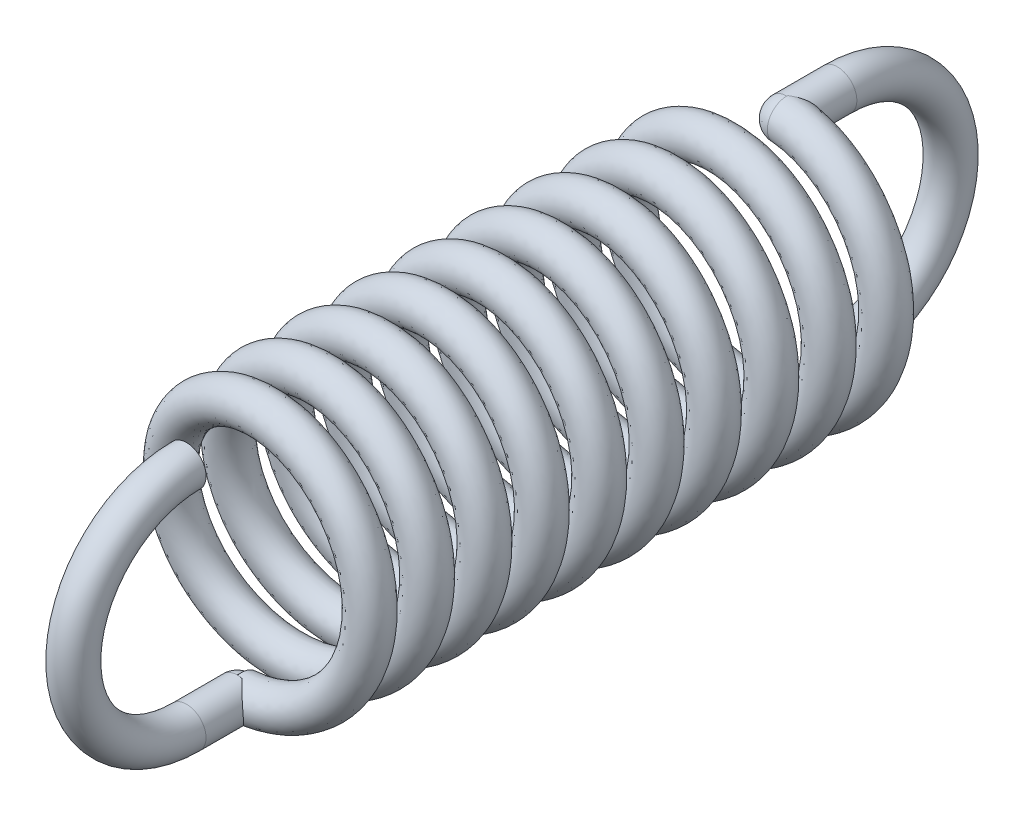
ISO-10303-21;
HEADER;
FILE_DESCRIPTION(('STEP AP214'),'2;1');
FILE_NAME('part.step','',(''),(''),'','','');
FILE_SCHEMA(('AUTOMOTIVE_DESIGN { 1 0 10303 214 1 1 1 1 }'));
ENDSEC;
DATA;
#1=APPLICATION_CONTEXT('core data for automotive mechanical design processes');
#2=APPLICATION_PROTOCOL_DEFINITION('international standard','automotive_design',2000,#1);
#3=PRODUCT_CONTEXT('',#1,'mechanical');
#4=PRODUCT('Part','Part','',(#3));
#5=PRODUCT_RELATED_PRODUCT_CATEGORY('part','',(#4));
#6=PRODUCT_DEFINITION_FORMATION('','',#4);
#7=PRODUCT_DEFINITION_CONTEXT('part definition',#1,'design');
#8=PRODUCT_DEFINITION('design','',#6,#7);
#9=PRODUCT_DEFINITION_SHAPE('','',#8);
#10=(LENGTH_UNIT() NAMED_UNIT(*) SI_UNIT(.MILLI.,.METRE.));
#11=(NAMED_UNIT(*) PLANE_ANGLE_UNIT() SI_UNIT($,.RADIAN.));
#12=(NAMED_UNIT(*) SI_UNIT($,.STERADIAN.) SOLID_ANGLE_UNIT());
#13=UNCERTAINTY_MEASURE_WITH_UNIT(LENGTH_MEASURE(1.E-05),#10,'distance_accuracy_value','');
#14=(GEOMETRIC_REPRESENTATION_CONTEXT(3) GLOBAL_UNCERTAINTY_ASSIGNED_CONTEXT((#13)) GLOBAL_UNIT_ASSIGNED_CONTEXT((#10,
#11,#12)) REPRESENTATION_CONTEXT('',''));
#15=CARTESIAN_POINT('',(0.,0.,0.));
#16=DIRECTION('',(0.,0.,1.));
#17=DIRECTION('',(1.,0.,0.));
#18=AXIS2_PLACEMENT_3D('',#15,#16,#17);
#19=CARTESIAN_POINT('',(1.21841044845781E-07,-2.9106959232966,13.9426770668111));
#20=DIRECTION('',(0.999999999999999,4.18597641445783E-08,0.));
#21=DIRECTION('',(0.,0.,1.));
#22=AXIS2_PLACEMENT_3D('',#19,#20,#21);
#23=PLANE('',#22);
#24=CARTESIAN_POINT('',(-1.21795500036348E-07,-2.9095990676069,14.0573230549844));
#25=DIRECTION('',(0.999999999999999,-4.18598908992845E-08,0.));
#26=DIRECTION('',(0.,4.18598908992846E-08,0.999999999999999));
#27=AXIS2_PLACEMENT_3D('',#24,#25,#26);
#28=CIRCLE('',#27,0.500000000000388);
#29=CARTESIAN_POINT('',(1.42609002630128E-07,-3.4068276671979,14.0047519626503));
#30=VERTEX_POINT('',#29);
#31=CARTESIAN_POINT('',(1.01027172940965E-07,-2.41346732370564,13.9952481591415));
#32=VERTEX_POINT('',#31);
#33=EDGE_CURVE('E49',#30,#32,#28,.T.);
#34=ORIENTED_EDGE('',*,*,#33,.T.);
#35=CARTESIAN_POINT('',(1.21841044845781E-07,-2.9106959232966,13.9426770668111));
#36=DIRECTION('',(0.999999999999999,4.18597641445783E-08,0.));
#37=DIRECTION('',(0.,0.,1.));
#38=AXIS2_PLACEMENT_3D('',#35,#36,#37);
#39=CIRCLE('',#38,0.5);
#40=EDGE_CURVE('E52',#30,#32,#39,.T.);
#41=ORIENTED_EDGE('',*,*,#40,.F.);
#42=EDGE_LOOP('',(#34,#41));
#43=FACE_BOUND('',#42,.T.);
#44=ADVANCED_FACE('F35',(#43),#23,.F.);
#45=CARTESIAN_POINT('',(0.,-2.90959906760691,14.0573229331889));
#46=DIRECTION('',(0.,0.,-1.));
#47=DIRECTION('',(1.,0.,0.));
#48=AXIS2_PLACEMENT_3D('',#45,#46,#47);
#49=PLANE('',#48);
#50=DIRECTION('',(-4.18598908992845E-08,-0.999999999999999,0.));
#51=VECTOR('',#50,1.);
#52=CARTESIAN_POINT('',(-1.00865554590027E-07,-2.40959906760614,14.0573229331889));
#53=LINE('',#52,#51);
#54=CARTESIAN_POINT('',(-1.00865554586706E-07,-2.40959906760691,14.0573229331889));
#55=VERTEX_POINT('',#54);
#56=CARTESIAN_POINT('',(1.01468782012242E-07,-2.42401705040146,14.0573229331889));
#57=VERTEX_POINT('',#56);
#58=EDGE_CURVE('E122',#55,#57,#53,.T.);
#59=ORIENTED_EDGE('',*,*,#58,.F.);
#60=CARTESIAN_POINT('',(0.,-2.90959906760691,14.0573229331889));
#61=DIRECTION('',(0.,0.,-1.));
#62=DIRECTION('',(1.,0.,0.));
#63=AXIS2_PLACEMENT_3D('',#60,#61,#62);
#64=CIRCLE('',#63,0.5);
#65=CARTESIAN_POINT('',(0.118054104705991,-2.42373568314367,14.0573229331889));
#66=VERTEX_POINT('',#65);
#67=EDGE_CURVE('E103',#55,#66,#64,.T.);
#68=ORIENTED_EDGE('',*,*,#67,.T.);
#69=CARTESIAN_POINT('',(1.01468799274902E-07,-2.42401705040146,14.0573229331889));
#70=CARTESIAN_POINT('',(0.0636855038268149,-2.42531686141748,14.0573229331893));
#71=CARTESIAN_POINT('',(0.127244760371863,-2.4242652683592,14.0573229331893));
#72=CARTESIAN_POINT('',(0.254110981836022,-2.41745927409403,14.0573229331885));
#73=CARTESIAN_POINT('',(0.317417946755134,-2.41170487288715,14.0573229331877));
#74=CARTESIAN_POINT('',(0.380598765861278,-2.40359906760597,14.0573229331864));
#75=B_SPLINE_CURVE_WITH_KNOTS('',3,(#69,#70,#71,#72,#73,#74),.UNSPECIFIED.,.F.,.F.,(4,2,4),(0.,
0.190703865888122,0.381407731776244),.UNSPECIFIED.);
#76=EDGE_CURVE('E43',#57,#66,#75,.T.);
#77=ORIENTED_EDGE('',*,*,#76,.F.);
#78=EDGE_LOOP('',(#59,#68,#77));
#79=FACE_BOUND('',#78,.T.);
#80=ADVANCED_FACE('F206',(#79),#49,.T.);
#81=CARTESIAN_POINT('',(-1.21841414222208E-07,2.9106959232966,-0.0573229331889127));
#82=DIRECTION('',(-0.999999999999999,-4.18598910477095E-08,0.));
#83=DIRECTION('',(0.,0.,1.));
#84=AXIS2_PLACEMENT_3D('',#81,#82,#83);
#85=PLANE('',#84);
#86=DIRECTION('',(0.,0.,1.));
#87=VECTOR('',#86,1.);
#88=CARTESIAN_POINT('',(-1.42725445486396E-07,3.40959906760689,-1.35732293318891));
#89=LINE('',#88,#87);
#90=CARTESIAN_POINT('',(-1.42725445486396E-07,3.40959906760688,-0.0573229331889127));
#91=VERTEX_POINT('',#90);
#92=CARTESIAN_POINT('',(-1.42725445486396E-07,3.40959906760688,-0.0904235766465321));
#93=VERTEX_POINT('',#92);
#94=EDGE_CURVE('E157',#91,#93,#89,.F.);
#95=ORIENTED_EDGE('',*,*,#94,.F.);
#96=CARTESIAN_POINT('',(-1.21795500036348E-07,2.9095990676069,-0.0573230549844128));
#97=DIRECTION('',(0.999999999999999,4.18598908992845E-08,0.));
#98=DIRECTION('',(0.,-4.18598908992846E-08,-0.999999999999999));
#99=AXIS2_PLACEMENT_3D('',#96,#97,#98);
#100=CIRCLE('',#99,0.500000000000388);
#101=CARTESIAN_POINT('',(-1.21841414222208E-07,2.9106959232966,0.442677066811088));
#102=VERTEX_POINT('',#101);
#103=EDGE_CURVE('E141',#91,#102,#100,.T.);
#104=ORIENTED_EDGE('',*,*,#103,.T.);
#105=CARTESIAN_POINT('',(-1.21841414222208E-07,2.9106959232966,-0.0573229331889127));
#106=DIRECTION('',(-0.999999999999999,-4.18598910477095E-08,0.));
#107=DIRECTION('',(0.,0.,1.));
#108=AXIS2_PLACEMENT_3D('',#105,#106,#107);
#109=CIRCLE('',#108,0.5);
#110=EDGE_CURVE('E160',#102,#93,#109,.T.);
#111=ORIENTED_EDGE('',*,*,#110,.T.);
#112=EDGE_LOOP('',(#95,#104,#111));
#113=FACE_BOUND('',#112,.T.);
#114=ADVANCED_FACE('F37',(#113),#85,.T.);
#115=CARTESIAN_POINT('',(-1.21841414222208E-07,2.9106959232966,0.442677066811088));
#116=CARTESIAN_POINT('',(1.68049095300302,2.91069599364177,0.565484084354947));
#117=CARTESIAN_POINT('',(2.52073655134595,1.45534806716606,0.688291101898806));
#118=CARTESIAN_POINT('',(3.36098214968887,1.40690346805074E-07,0.811098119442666));
#119=CARTESIAN_POINT('',(2.52073667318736,-1.45534785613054,0.933905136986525));
#120=CARTESIAN_POINT('',(1.68049119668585,-2.91069585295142,1.05671215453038));
#121=CARTESIAN_POINT('',(1.21841414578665E-07,-2.9106959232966,1.17951917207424));
#122=CARTESIAN_POINT('',(-1.68049095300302,-2.91069599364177,1.3023261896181));
#123=CARTESIAN_POINT('',(-2.52073655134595,-1.45534806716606,1.42513320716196));
#124=CARTESIAN_POINT('',(-3.36098214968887,-1.40690347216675E-07,1.54794022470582));
#125=CARTESIAN_POINT('',(-2.52073667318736,1.45534785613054,1.67074724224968));
#126=CARTESIAN_POINT('',(-1.68049119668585,2.91069585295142,1.79355425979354));
#127=CARTESIAN_POINT('',(-1.21841414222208E-07,2.9106959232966,1.9163612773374));
#128=CARTESIAN_POINT('',(1.68049095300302,2.91069599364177,2.03916829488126));
#129=CARTESIAN_POINT('',(2.52073655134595,1.45534806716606,2.16197531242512));
#130=CARTESIAN_POINT('',(3.36098214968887,1.40690346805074E-07,2.28478232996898));
#131=CARTESIAN_POINT('',(2.52073667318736,-1.45534785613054,2.40758934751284));
#132=CARTESIAN_POINT('',(1.68049119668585,-2.91069585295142,2.5303963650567));
#133=CARTESIAN_POINT('',(1.21841414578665E-07,-2.9106959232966,2.65320338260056));
#134=CARTESIAN_POINT('',(-1.68049095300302,-2.91069599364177,2.77601040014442));
#135=CARTESIAN_POINT('',(-2.52073655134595,-1.45534806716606,2.89881741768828));
#136=CARTESIAN_POINT('',(-3.36098214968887,-1.40690347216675E-07,3.02162443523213));
#137=CARTESIAN_POINT('',(-2.52073667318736,1.45534785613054,3.14443145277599));
#138=CARTESIAN_POINT('',(-1.68049119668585,2.91069585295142,3.26723847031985));
#139=CARTESIAN_POINT('',(-1.21841414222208E-07,2.9106959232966,3.39004548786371));
#140=CARTESIAN_POINT('',(1.68049095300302,2.91069599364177,3.51285250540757));
#141=CARTESIAN_POINT('',(2.52073655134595,1.45534806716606,3.63565952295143));
#142=CARTESIAN_POINT('',(3.36098214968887,1.40690346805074E-07,3.75846654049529));
#143=CARTESIAN_POINT('',(2.52073667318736,-1.45534785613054,3.88127355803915));
#144=CARTESIAN_POINT('',(1.68049119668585,-2.91069585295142,4.00408057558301));
#145=CARTESIAN_POINT('',(1.21841414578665E-07,-2.9106959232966,4.12688759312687));
#146=CARTESIAN_POINT('',(-1.68049095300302,-2.91069599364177,4.24969461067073));
#147=CARTESIAN_POINT('',(-2.52073655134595,-1.45534806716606,4.37250162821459));
#148=CARTESIAN_POINT('',(-3.36098214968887,-1.40690347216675E-07,4.49530864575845));
#149=CARTESIAN_POINT('',(-2.52073667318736,1.45534785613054,4.61811566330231));
#150=CARTESIAN_POINT('',(-1.68049119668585,2.91069585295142,4.74092268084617));
#151=CARTESIAN_POINT('',(-1.21841414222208E-07,2.9106959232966,4.86372969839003));
#152=CARTESIAN_POINT('',(1.68049095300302,2.91069599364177,4.98653671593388));
#153=CARTESIAN_POINT('',(2.52073655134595,1.45534806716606,5.10934373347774));
#154=CARTESIAN_POINT('',(3.36098214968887,1.40690346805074E-07,5.2321507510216));
#155=CARTESIAN_POINT('',(2.52073667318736,-1.45534785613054,5.35495776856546));
#156=CARTESIAN_POINT('',(1.68049119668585,-2.91069585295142,5.47776478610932));
#157=CARTESIAN_POINT('',(1.21841414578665E-07,-2.9106959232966,5.60057180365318));
#158=CARTESIAN_POINT('',(-1.68049095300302,-2.91069599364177,5.72337882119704));
#159=CARTESIAN_POINT('',(-2.52073655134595,-1.45534806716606,5.8461858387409));
#160=CARTESIAN_POINT('',(-3.36098214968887,-1.40690347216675E-07,5.96899285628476));
#161=CARTESIAN_POINT('',(-2.52073667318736,1.45534785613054,6.09179987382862));
#162=CARTESIAN_POINT('',(-1.68049119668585,2.91069585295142,6.21460689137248));
#163=CARTESIAN_POINT('',(-1.21841414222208E-07,2.9106959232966,6.33741390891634));
#164=CARTESIAN_POINT('',(1.68049095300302,2.91069599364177,6.4602209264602));
#165=CARTESIAN_POINT('',(2.52073655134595,1.45534806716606,6.58302794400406));
#166=CARTESIAN_POINT('',(3.36098214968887,1.40690346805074E-07,6.70583496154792));
#167=CARTESIAN_POINT('',(2.52073667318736,-1.45534785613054,6.82864197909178));
#168=CARTESIAN_POINT('',(1.68049119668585,-2.91069585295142,6.95144899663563));
#169=CARTESIAN_POINT('',(1.21841414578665E-07,-2.9106959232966,7.07425601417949));
#170=CARTESIAN_POINT('',(-1.68049095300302,-2.91069599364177,7.19706303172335));
#171=CARTESIAN_POINT('',(-2.52073655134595,-1.45534806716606,7.31987004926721));
#172=CARTESIAN_POINT('',(-3.36098214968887,-1.40690347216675E-07,7.44267706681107));
#173=CARTESIAN_POINT('',(-2.52073667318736,1.45534785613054,7.56548408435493));
#174=CARTESIAN_POINT('',(-1.68049119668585,2.91069585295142,7.68829110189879));
#175=CARTESIAN_POINT('',(-1.21841414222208E-07,2.9106959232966,7.81109811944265));
#176=CARTESIAN_POINT('',(1.68049095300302,2.91069599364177,7.93390513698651));
#177=CARTESIAN_POINT('',(2.52073655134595,1.45534806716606,8.05671215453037));
#178=CARTESIAN_POINT('',(3.36098214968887,1.40690346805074E-07,8.17951917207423));
#179=CARTESIAN_POINT('',(2.52073667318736,-1.45534785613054,8.30232618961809));
#180=CARTESIAN_POINT('',(1.68049119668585,-2.91069585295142,8.42513320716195));
#181=CARTESIAN_POINT('',(1.21841414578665E-07,-2.9106959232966,8.54794022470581));
#182=CARTESIAN_POINT('',(-1.68049095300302,-2.91069599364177,8.67074724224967));
#183=CARTESIAN_POINT('',(-2.52073655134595,-1.45534806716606,8.79355425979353));
#184=CARTESIAN_POINT('',(-3.36098214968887,-1.40690347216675E-07,8.91636127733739));
#185=CARTESIAN_POINT('',(-2.52073667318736,1.45534785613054,9.03916829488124));
#186=CARTESIAN_POINT('',(-1.68049119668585,2.91069585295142,9.1619753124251));
#187=CARTESIAN_POINT('',(-1.21841414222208E-07,2.9106959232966,9.28478232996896));
#188=CARTESIAN_POINT('',(1.68049095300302,2.91069599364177,9.40758934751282));
#189=CARTESIAN_POINT('',(2.52073655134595,1.45534806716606,9.53039636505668));
#190=CARTESIAN_POINT('',(3.36098214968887,1.40690346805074E-07,9.65320338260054));
#191=CARTESIAN_POINT('',(2.52073667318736,-1.45534785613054,9.7760104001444));
#192=CARTESIAN_POINT('',(1.68049119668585,-2.91069585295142,9.89881741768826));
#193=CARTESIAN_POINT('',(1.21841414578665E-07,-2.9106959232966,10.0216244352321));
#194=CARTESIAN_POINT('',(-1.68049095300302,-2.91069599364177,10.144431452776));
#195=CARTESIAN_POINT('',(-2.52073655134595,-1.45534806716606,10.2672384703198));
#196=CARTESIAN_POINT('',(-3.36098214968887,-1.40690347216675E-07,10.3900454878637));
#197=CARTESIAN_POINT('',(-2.52073667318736,1.45534785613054,10.5128525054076));
#198=CARTESIAN_POINT('',(-1.68049119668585,2.91069585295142,10.6356595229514));
#199=CARTESIAN_POINT('',(-1.21841414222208E-07,2.9106959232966,10.7584665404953));
#200=CARTESIAN_POINT('',(1.68049095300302,2.91069599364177,10.8812735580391));
#201=CARTESIAN_POINT('',(2.52073655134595,1.45534806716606,11.004080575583));
#202=CARTESIAN_POINT('',(3.36098214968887,1.40690346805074E-07,11.1268875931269));
#203=CARTESIAN_POINT('',(2.52073667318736,-1.45534785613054,11.2496946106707));
#204=CARTESIAN_POINT('',(1.68049119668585,-2.91069585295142,11.3725016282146));
#205=CARTESIAN_POINT('',(1.21841414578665E-07,-2.9106959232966,11.4953086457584));
#206=CARTESIAN_POINT('',(-1.68049095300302,-2.91069599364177,11.6181156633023));
#207=CARTESIAN_POINT('',(-2.52073655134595,-1.45534806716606,11.7409226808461));
#208=CARTESIAN_POINT('',(-3.36098214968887,-1.40690347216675E-07,11.86372969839));
#209=CARTESIAN_POINT('',(-2.52073667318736,1.45534785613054,11.9865367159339));
#210=CARTESIAN_POINT('',(-1.68049119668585,2.91069585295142,12.1093437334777));
#211=CARTESIAN_POINT('',(-1.21841414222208E-07,2.9106959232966,12.2321507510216));
#212=CARTESIAN_POINT('',(1.68049095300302,2.91069599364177,12.3549577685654));
#213=CARTESIAN_POINT('',(2.52073655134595,1.45534806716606,12.4777647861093));
#214=CARTESIAN_POINT('',(3.36098214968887,1.40690346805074E-07,12.6005718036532));
#215=CARTESIAN_POINT('',(2.52073667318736,-1.45534785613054,12.723378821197));
#216=CARTESIAN_POINT('',(1.68049119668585,-2.91069585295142,12.8461858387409));
#217=CARTESIAN_POINT('',(1.21841414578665E-07,-2.9106959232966,12.9689928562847));
#218=CARTESIAN_POINT('',(-1.68049095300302,-2.91069599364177,13.0917998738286));
#219=CARTESIAN_POINT('',(-2.52073655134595,-1.45534806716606,13.2146068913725));
#220=CARTESIAN_POINT('',(-3.36098214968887,-1.40690347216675E-07,13.3374139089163));
#221=CARTESIAN_POINT('',(-2.52073667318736,1.45534785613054,13.4602209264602));
#222=CARTESIAN_POINT('',(-1.68049119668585,2.91069585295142,13.583027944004));
#223=CARTESIAN_POINT('',(-1.21841414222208E-07,2.9106959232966,13.7058349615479));
#224=CARTESIAN_POINT('',(1.68049095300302,2.91069599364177,13.8286419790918));
#225=CARTESIAN_POINT('',(2.52073655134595,1.45534806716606,13.9514489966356));
#226=CARTESIAN_POINT('',(3.36098214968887,1.40690346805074E-07,14.0742560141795));
#227=CARTESIAN_POINT('',(2.52073667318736,-1.45534785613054,14.1970630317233));
#228=CARTESIAN_POINT('',(1.68049119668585,-2.91069585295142,14.3198700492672));
#229=CARTESIAN_POINT('',(1.21841414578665E-07,-2.9106959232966,14.4426770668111));
#230=CARTESIAN_POINT('',(-1.68049095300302,-2.91069599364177,14.5654840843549));
#231=CARTESIAN_POINT('',(-2.52073655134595,-1.45534806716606,14.6882911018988));
#232=CARTESIAN_POINT('',(-3.36098214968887,-1.40690347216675E-07,14.8110981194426));
#233=CARTESIAN_POINT('',(-2.52073667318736,1.45534785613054,14.9339051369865));
#234=CARTESIAN_POINT('',(-1.68049119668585,2.91069585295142,15.0567121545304));
#235=CARTESIAN_POINT('',(-1.21841414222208E-07,2.9106959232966,15.1795191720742));
#236=CARTESIAN_POINT('',(-1.63701305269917E-07,3.9106959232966,0.442677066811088));
#237=CARTESIAN_POINT('',(2.25784118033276,3.91069601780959,0.565484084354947));
#238=CARTESIAN_POINT('',(3.38676193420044,1.95534810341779,0.688291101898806));
#239=CARTESIAN_POINT('',(4.51568268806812,1.89025985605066E-07,0.811098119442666));
#240=CARTESIAN_POINT('',(3.38676209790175,-1.95534781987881,0.933905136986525));
#241=CARTESIAN_POINT('',(2.25784150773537,-3.9106958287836,1.05671215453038));
#242=CARTESIAN_POINT('',(1.63701305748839E-07,-3.9106959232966,1.17951917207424));
#243=CARTESIAN_POINT('',(-2.25784118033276,-3.91069601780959,1.3023261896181));
#244=CARTESIAN_POINT('',(-3.38676193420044,-1.95534810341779,1.42513320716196));
#245=CARTESIAN_POINT('',(-4.51568268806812,-1.89025986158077E-07,1.54794022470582));
#246=CARTESIAN_POINT('',(-3.38676209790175,1.95534781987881,1.67074724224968));
#247=CARTESIAN_POINT('',(-2.25784150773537,3.9106958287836,1.79355425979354));
#248=CARTESIAN_POINT('',(-1.63701305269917E-07,3.9106959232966,1.9163612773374));
#249=CARTESIAN_POINT('',(2.25784118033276,3.91069601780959,2.03916829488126));
#250=CARTESIAN_POINT('',(3.38676193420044,1.95534810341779,2.16197531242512));
#251=CARTESIAN_POINT('',(4.51568268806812,1.89025985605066E-07,2.28478232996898));
#252=CARTESIAN_POINT('',(3.38676209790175,-1.95534781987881,2.40758934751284));
#253=CARTESIAN_POINT('',(2.25784150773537,-3.9106958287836,2.5303963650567));
#254=CARTESIAN_POINT('',(1.63701305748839E-07,-3.9106959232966,2.65320338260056));
#255=CARTESIAN_POINT('',(-2.25784118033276,-3.91069601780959,2.77601040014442));
#256=CARTESIAN_POINT('',(-3.38676193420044,-1.95534810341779,2.89881741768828));
#257=CARTESIAN_POINT('',(-4.51568268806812,-1.89025986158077E-07,3.02162443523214));
#258=CARTESIAN_POINT('',(-3.38676209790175,1.95534781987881,3.14443145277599));
#259=CARTESIAN_POINT('',(-2.25784150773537,3.9106958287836,3.26723847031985));
#260=CARTESIAN_POINT('',(-1.63701305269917E-07,3.9106959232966,3.39004548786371));
#261=CARTESIAN_POINT('',(2.25784118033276,3.91069601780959,3.51285250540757));
#262=CARTESIAN_POINT('',(3.38676193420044,1.95534810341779,3.63565952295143));
#263=CARTESIAN_POINT('',(4.51568268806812,1.89025985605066E-07,3.75846654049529));
#264=CARTESIAN_POINT('',(3.38676209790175,-1.95534781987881,3.88127355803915));
#265=CARTESIAN_POINT('',(2.25784150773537,-3.9106958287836,4.00408057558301));
#266=CARTESIAN_POINT('',(1.63701305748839E-07,-3.9106959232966,4.12688759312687));
#267=CARTESIAN_POINT('',(-2.25784118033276,-3.91069601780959,4.24969461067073));
#268=CARTESIAN_POINT('',(-3.38676193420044,-1.95534810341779,4.37250162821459));
#269=CARTESIAN_POINT('',(-4.51568268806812,-1.89025986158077E-07,4.49530864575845));
#270=CARTESIAN_POINT('',(-3.38676209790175,1.95534781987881,4.61811566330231));
#271=CARTESIAN_POINT('',(-2.25784150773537,3.9106958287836,4.74092268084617));
#272=CARTESIAN_POINT('',(-1.63701305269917E-07,3.9106959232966,4.86372969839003));
#273=CARTESIAN_POINT('',(2.25784118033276,3.91069601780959,4.98653671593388));
#274=CARTESIAN_POINT('',(3.38676193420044,1.95534810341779,5.10934373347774));
#275=CARTESIAN_POINT('',(4.51568268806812,1.89025985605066E-07,5.2321507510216));
#276=CARTESIAN_POINT('',(3.38676209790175,-1.95534781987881,5.35495776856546));
#277=CARTESIAN_POINT('',(2.25784150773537,-3.9106958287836,5.47776478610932));
#278=CARTESIAN_POINT('',(1.63701305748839E-07,-3.9106959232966,5.60057180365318));
#279=CARTESIAN_POINT('',(-2.25784118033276,-3.91069601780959,5.72337882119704));
#280=CARTESIAN_POINT('',(-3.38676193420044,-1.95534810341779,5.8461858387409));
#281=CARTESIAN_POINT('',(-4.51568268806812,-1.89025986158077E-07,5.96899285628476));
#282=CARTESIAN_POINT('',(-3.38676209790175,1.95534781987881,6.09179987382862));
#283=CARTESIAN_POINT('',(-2.25784150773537,3.9106958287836,6.21460689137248));
#284=CARTESIAN_POINT('',(-1.63701305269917E-07,3.9106959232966,6.33741390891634));
#285=CARTESIAN_POINT('',(2.25784118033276,3.91069601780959,6.4602209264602));
#286=CARTESIAN_POINT('',(3.38676193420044,1.95534810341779,6.58302794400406));
#287=CARTESIAN_POINT('',(4.51568268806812,1.89025985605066E-07,6.70583496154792));
#288=CARTESIAN_POINT('',(3.38676209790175,-1.95534781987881,6.82864197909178));
#289=CARTESIAN_POINT('',(2.25784150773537,-3.9106958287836,6.95144899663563));
#290=CARTESIAN_POINT('',(1.63701305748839E-07,-3.9106959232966,7.07425601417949));
#291=CARTESIAN_POINT('',(-2.25784118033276,-3.91069601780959,7.19706303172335));
#292=CARTESIAN_POINT('',(-3.38676193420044,-1.95534810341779,7.31987004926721));
#293=CARTESIAN_POINT('',(-4.51568268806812,-1.89025986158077E-07,7.44267706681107));
#294=CARTESIAN_POINT('',(-3.38676209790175,1.95534781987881,7.56548408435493));
#295=CARTESIAN_POINT('',(-2.25784150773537,3.9106958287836,7.68829110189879));
#296=CARTESIAN_POINT('',(-1.63701305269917E-07,3.9106959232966,7.81109811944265));
#297=CARTESIAN_POINT('',(2.25784118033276,3.91069601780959,7.93390513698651));
#298=CARTESIAN_POINT('',(3.38676193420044,1.95534810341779,8.05671215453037));
#299=CARTESIAN_POINT('',(4.51568268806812,1.89025985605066E-07,8.17951917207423));
#300=CARTESIAN_POINT('',(3.38676209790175,-1.95534781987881,8.30232618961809));
#301=CARTESIAN_POINT('',(2.25784150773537,-3.9106958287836,8.42513320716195));
#302=CARTESIAN_POINT('',(1.63701305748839E-07,-3.9106959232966,8.54794022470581));
#303=CARTESIAN_POINT('',(-2.25784118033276,-3.91069601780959,8.67074724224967));
#304=CARTESIAN_POINT('',(-3.38676193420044,-1.95534810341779,8.79355425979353));
#305=CARTESIAN_POINT('',(-4.51568268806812,-1.89025986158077E-07,8.91636127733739));
#306=CARTESIAN_POINT('',(-3.38676209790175,1.95534781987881,9.03916829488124));
#307=CARTESIAN_POINT('',(-2.25784150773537,3.9106958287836,9.1619753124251));
#308=CARTESIAN_POINT('',(-1.63701305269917E-07,3.9106959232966,9.28478232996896));
#309=CARTESIAN_POINT('',(2.25784118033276,3.91069601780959,9.40758934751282));
#310=CARTESIAN_POINT('',(3.38676193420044,1.95534810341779,9.53039636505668));
#311=CARTESIAN_POINT('',(4.51568268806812,1.89025985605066E-07,9.65320338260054));
#312=CARTESIAN_POINT('',(3.38676209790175,-1.95534781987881,9.7760104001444));
#313=CARTESIAN_POINT('',(2.25784150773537,-3.9106958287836,9.89881741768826));
#314=CARTESIAN_POINT('',(1.63701305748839E-07,-3.9106959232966,10.0216244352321));
#315=CARTESIAN_POINT('',(-2.25784118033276,-3.91069601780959,10.144431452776));
#316=CARTESIAN_POINT('',(-3.38676193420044,-1.95534810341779,10.2672384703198));
#317=CARTESIAN_POINT('',(-4.51568268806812,-1.89025986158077E-07,10.3900454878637));
#318=CARTESIAN_POINT('',(-3.38676209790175,1.95534781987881,10.5128525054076));
#319=CARTESIAN_POINT('',(-2.25784150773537,3.9106958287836,10.6356595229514));
#320=CARTESIAN_POINT('',(-1.63701305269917E-07,3.9106959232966,10.7584665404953));
#321=CARTESIAN_POINT('',(2.25784118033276,3.91069601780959,10.8812735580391));
#322=CARTESIAN_POINT('',(3.38676193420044,1.95534810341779,11.004080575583));
#323=CARTESIAN_POINT('',(4.51568268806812,1.89025985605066E-07,11.1268875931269));
#324=CARTESIAN_POINT('',(3.38676209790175,-1.95534781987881,11.2496946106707));
#325=CARTESIAN_POINT('',(2.25784150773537,-3.9106958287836,11.3725016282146));
#326=CARTESIAN_POINT('',(1.63701305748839E-07,-3.9106959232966,11.4953086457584));
#327=CARTESIAN_POINT('',(-2.25784118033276,-3.91069601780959,11.6181156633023));
#328=CARTESIAN_POINT('',(-3.38676193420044,-1.95534810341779,11.7409226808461));
#329=CARTESIAN_POINT('',(-4.51568268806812,-1.89025986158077E-07,11.86372969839));
#330=CARTESIAN_POINT('',(-3.38676209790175,1.95534781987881,11.9865367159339));
#331=CARTESIAN_POINT('',(-2.25784150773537,3.9106958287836,12.1093437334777));
#332=CARTESIAN_POINT('',(-1.63701305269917E-07,3.9106959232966,12.2321507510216));
#333=CARTESIAN_POINT('',(2.25784118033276,3.91069601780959,12.3549577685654));
#334=CARTESIAN_POINT('',(3.38676193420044,1.95534810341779,12.4777647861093));
#335=CARTESIAN_POINT('',(4.51568268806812,1.89025985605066E-07,12.6005718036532));
#336=CARTESIAN_POINT('',(3.38676209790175,-1.95534781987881,12.723378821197));
#337=CARTESIAN_POINT('',(2.25784150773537,-3.9106958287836,12.8461858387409));
#338=CARTESIAN_POINT('',(1.63701305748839E-07,-3.9106959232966,12.9689928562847));
#339=CARTESIAN_POINT('',(-2.25784118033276,-3.91069601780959,13.0917998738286));
#340=CARTESIAN_POINT('',(-3.38676193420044,-1.95534810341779,13.2146068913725));
#341=CARTESIAN_POINT('',(-4.51568268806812,-1.89025986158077E-07,13.3374139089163));
#342=CARTESIAN_POINT('',(-3.38676209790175,1.95534781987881,13.4602209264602));
#343=CARTESIAN_POINT('',(-2.25784150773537,3.9106958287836,13.583027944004));
#344=CARTESIAN_POINT('',(-1.63701305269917E-07,3.9106959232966,13.7058349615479));
#345=CARTESIAN_POINT('',(2.25784118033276,3.91069601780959,13.8286419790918));
#346=CARTESIAN_POINT('',(3.38676193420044,1.95534810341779,13.9514489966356));
#347=CARTESIAN_POINT('',(4.51568268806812,1.89025985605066E-07,14.0742560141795));
#348=CARTESIAN_POINT('',(3.38676209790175,-1.95534781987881,14.1970630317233));
#349=CARTESIAN_POINT('',(2.25784150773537,-3.9106958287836,14.3198700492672));
#350=CARTESIAN_POINT('',(1.63701305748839E-07,-3.9106959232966,14.4426770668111));
#351=CARTESIAN_POINT('',(-2.25784118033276,-3.91069601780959,14.5654840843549));
#352=CARTESIAN_POINT('',(-3.38676193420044,-1.95534810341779,14.6882911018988));
#353=CARTESIAN_POINT('',(-4.51568268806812,-1.89025986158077E-07,14.8110981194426));
#354=CARTESIAN_POINT('',(-3.38676209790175,1.95534781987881,14.9339051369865));
#355=CARTESIAN_POINT('',(-2.25784150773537,3.9106958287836,15.0567121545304));
#356=CARTESIAN_POINT('',(-1.63701305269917E-07,3.9106959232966,15.1795191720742));
#357=CARTESIAN_POINT('',(-1.63701305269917E-07,3.9106959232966,-0.557322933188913));
#358=CARTESIAN_POINT('',(2.25784118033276,3.91069601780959,-0.434515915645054));
#359=CARTESIAN_POINT('',(3.38676193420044,1.95534810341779,-0.311708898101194));
#360=CARTESIAN_POINT('',(4.51568268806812,1.89025985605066E-07,-0.188901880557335));
#361=CARTESIAN_POINT('',(3.38676209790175,-1.95534781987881,-0.0660948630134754));
#362=CARTESIAN_POINT('',(2.25784150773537,-3.9106958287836,0.0567121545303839));
#363=CARTESIAN_POINT('',(1.63701305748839E-07,-3.9106959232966,0.179519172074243));
#364=CARTESIAN_POINT('',(-2.25784118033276,-3.91069601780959,0.302326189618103));
#365=CARTESIAN_POINT('',(-3.38676193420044,-1.95534810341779,0.425133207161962));
#366=CARTESIAN_POINT('',(-4.51568268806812,-1.89025986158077E-07,0.547940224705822));
#367=CARTESIAN_POINT('',(-3.38676209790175,1.95534781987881,0.670747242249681));
#368=CARTESIAN_POINT('',(-2.25784150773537,3.9106958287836,0.79355425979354));
#369=CARTESIAN_POINT('',(-1.63701305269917E-07,3.9106959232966,0.9163612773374));
#370=CARTESIAN_POINT('',(2.25784118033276,3.91069601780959,1.03916829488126));
#371=CARTESIAN_POINT('',(3.38676193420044,1.95534810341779,1.16197531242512));
#372=CARTESIAN_POINT('',(4.51568268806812,1.89025985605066E-07,1.28478232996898));
#373=CARTESIAN_POINT('',(3.38676209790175,-1.95534781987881,1.40758934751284));
#374=CARTESIAN_POINT('',(2.25784150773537,-3.9106958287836,1.5303963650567));
#375=CARTESIAN_POINT('',(1.63701305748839E-07,-3.9106959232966,1.65320338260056));
#376=CARTESIAN_POINT('',(-2.25784118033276,-3.91069601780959,1.77601040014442));
#377=CARTESIAN_POINT('',(-3.38676193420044,-1.95534810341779,1.89881741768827));
#378=CARTESIAN_POINT('',(-4.51568268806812,-1.89025986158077E-07,2.02162443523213));
#379=CARTESIAN_POINT('',(-3.38676209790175,1.95534781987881,2.14443145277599));
#380=CARTESIAN_POINT('',(-2.25784150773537,3.9106958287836,2.26723847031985));
#381=CARTESIAN_POINT('',(-1.63701305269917E-07,3.9106959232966,2.39004548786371));
#382=CARTESIAN_POINT('',(2.25784118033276,3.91069601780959,2.51285250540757));
#383=CARTESIAN_POINT('',(3.38676193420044,1.95534810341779,2.63565952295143));
#384=CARTESIAN_POINT('',(4.51568268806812,1.89025985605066E-07,2.75846654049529));
#385=CARTESIAN_POINT('',(3.38676209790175,-1.95534781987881,2.88127355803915));
#386=CARTESIAN_POINT('',(2.25784150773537,-3.9106958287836,3.00408057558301));
#387=CARTESIAN_POINT('',(1.63701305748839E-07,-3.9106959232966,3.12688759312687));
#388=CARTESIAN_POINT('',(-2.25784118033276,-3.91069601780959,3.24969461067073));
#389=CARTESIAN_POINT('',(-3.38676193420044,-1.95534810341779,3.37250162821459));
#390=CARTESIAN_POINT('',(-4.51568268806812,-1.89025986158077E-07,3.49530864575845));
#391=CARTESIAN_POINT('',(-3.38676209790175,1.95534781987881,3.61811566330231));
#392=CARTESIAN_POINT('',(-2.25784150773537,3.9106958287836,3.74092268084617));
#393=CARTESIAN_POINT('',(-1.63701305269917E-07,3.9106959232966,3.86372969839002));
#394=CARTESIAN_POINT('',(2.25784118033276,3.91069601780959,3.98653671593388));
#395=CARTESIAN_POINT('',(3.38676193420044,1.95534810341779,4.10934373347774));
#396=CARTESIAN_POINT('',(4.51568268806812,1.89025985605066E-07,4.2321507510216));
#397=CARTESIAN_POINT('',(3.38676209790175,-1.95534781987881,4.35495776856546));
#398=CARTESIAN_POINT('',(2.25784150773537,-3.9106958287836,4.47776478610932));
#399=CARTESIAN_POINT('',(1.63701305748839E-07,-3.9106959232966,4.60057180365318));
#400=CARTESIAN_POINT('',(-2.25784118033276,-3.91069601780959,4.72337882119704));
#401=CARTESIAN_POINT('',(-3.38676193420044,-1.95534810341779,4.8461858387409));
#402=CARTESIAN_POINT('',(-4.51568268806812,-1.89025986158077E-07,4.96899285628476));
#403=CARTESIAN_POINT('',(-3.38676209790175,1.95534781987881,5.09179987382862));
#404=CARTESIAN_POINT('',(-2.25784150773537,3.9106958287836,5.21460689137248));
#405=CARTESIAN_POINT('',(-1.63701305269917E-07,3.9106959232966,5.33741390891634));
#406=CARTESIAN_POINT('',(2.25784118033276,3.91069601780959,5.4602209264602));
#407=CARTESIAN_POINT('',(3.38676193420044,1.95534810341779,5.58302794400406));
#408=CARTESIAN_POINT('',(4.51568268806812,1.89025985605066E-07,5.70583496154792));
#409=CARTESIAN_POINT('',(3.38676209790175,-1.95534781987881,5.82864197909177));
#410=CARTESIAN_POINT('',(2.25784150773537,-3.9106958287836,5.95144899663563));
#411=CARTESIAN_POINT('',(1.63701305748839E-07,-3.9106959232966,6.07425601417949));
#412=CARTESIAN_POINT('',(-2.25784118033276,-3.91069601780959,6.19706303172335));
#413=CARTESIAN_POINT('',(-3.38676193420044,-1.95534810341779,6.31987004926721));
#414=CARTESIAN_POINT('',(-4.51568268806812,-1.89025986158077E-07,6.44267706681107));
#415=CARTESIAN_POINT('',(-3.38676209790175,1.95534781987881,6.56548408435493));
#416=CARTESIAN_POINT('',(-2.25784150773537,3.9106958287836,6.68829110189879));
#417=CARTESIAN_POINT('',(-1.63701305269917E-07,3.9106959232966,6.81109811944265));
#418=CARTESIAN_POINT('',(2.25784118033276,3.91069601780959,6.93390513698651));
#419=CARTESIAN_POINT('',(3.38676193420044,1.95534810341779,7.05671215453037));
#420=CARTESIAN_POINT('',(4.51568268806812,1.89025985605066E-07,7.17951917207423));
#421=CARTESIAN_POINT('',(3.38676209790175,-1.95534781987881,7.30232618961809));
#422=CARTESIAN_POINT('',(2.25784150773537,-3.9106958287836,7.42513320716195));
#423=CARTESIAN_POINT('',(1.63701305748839E-07,-3.9106959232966,7.54794022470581));
#424=CARTESIAN_POINT('',(-2.25784118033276,-3.91069601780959,7.67074724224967));
#425=CARTESIAN_POINT('',(-3.38676193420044,-1.95534810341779,7.79355425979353));
#426=CARTESIAN_POINT('',(-4.51568268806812,-1.89025986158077E-07,7.91636127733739));
#427=CARTESIAN_POINT('',(-3.38676209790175,1.95534781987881,8.03916829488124));
#428=CARTESIAN_POINT('',(-2.25784150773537,3.9106958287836,8.1619753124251));
#429=CARTESIAN_POINT('',(-1.63701305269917E-07,3.9106959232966,8.28478232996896));
#430=CARTESIAN_POINT('',(2.25784118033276,3.91069601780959,8.40758934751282));
#431=CARTESIAN_POINT('',(3.38676193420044,1.95534810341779,8.53039636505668));
#432=CARTESIAN_POINT('',(4.51568268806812,1.89025985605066E-07,8.65320338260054));
#433=CARTESIAN_POINT('',(3.38676209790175,-1.95534781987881,8.7760104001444));
#434=CARTESIAN_POINT('',(2.25784150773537,-3.9106958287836,8.89881741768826));
#435=CARTESIAN_POINT('',(1.63701305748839E-07,-3.9106959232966,9.02162443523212));
#436=CARTESIAN_POINT('',(-2.25784118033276,-3.91069601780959,9.14443145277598));
#437=CARTESIAN_POINT('',(-3.38676193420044,-1.95534810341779,9.26723847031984));
#438=CARTESIAN_POINT('',(-4.51568268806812,-1.89025986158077E-07,9.3900454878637));
#439=CARTESIAN_POINT('',(-3.38676209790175,1.95534781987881,9.51285250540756));
#440=CARTESIAN_POINT('',(-2.25784150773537,3.9106958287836,9.63565952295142));
#441=CARTESIAN_POINT('',(-1.63701305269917E-07,3.9106959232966,9.75846654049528));
#442=CARTESIAN_POINT('',(2.25784118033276,3.91069601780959,9.88127355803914));
#443=CARTESIAN_POINT('',(3.38676193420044,1.95534810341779,10.004080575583));
#444=CARTESIAN_POINT('',(4.51568268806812,1.89025985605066E-07,10.1268875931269));
#445=CARTESIAN_POINT('',(3.38676209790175,-1.95534781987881,10.2496946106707));
#446=CARTESIAN_POINT('',(2.25784150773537,-3.9106958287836,10.3725016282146));
#447=CARTESIAN_POINT('',(1.63701305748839E-07,-3.9106959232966,10.4953086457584));
#448=CARTESIAN_POINT('',(-2.25784118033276,-3.91069601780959,10.6181156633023));
#449=CARTESIAN_POINT('',(-3.38676193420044,-1.95534810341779,10.7409226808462));
#450=CARTESIAN_POINT('',(-4.51568268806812,-1.89025986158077E-07,10.86372969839));
#451=CARTESIAN_POINT('',(-3.38676209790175,1.95534781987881,10.9865367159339));
#452=CARTESIAN_POINT('',(-2.25784150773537,3.9106958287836,11.1093437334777));
#453=CARTESIAN_POINT('',(-1.63701305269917E-07,3.9106959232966,11.2321507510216));
#454=CARTESIAN_POINT('',(2.25784118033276,3.91069601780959,11.3549577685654));
#455=CARTESIAN_POINT('',(3.38676193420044,1.95534810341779,11.4777647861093));
#456=CARTESIAN_POINT('',(4.51568268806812,1.89025985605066E-07,11.6005718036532));
#457=CARTESIAN_POINT('',(3.38676209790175,-1.95534781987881,11.723378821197));
#458=CARTESIAN_POINT('',(2.25784150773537,-3.9106958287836,11.8461858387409));
#459=CARTESIAN_POINT('',(1.63701305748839E-07,-3.9106959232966,11.9689928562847));
#460=CARTESIAN_POINT('',(-2.25784118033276,-3.91069601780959,12.0917998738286));
#461=CARTESIAN_POINT('',(-3.38676193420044,-1.95534810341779,12.2146068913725));
#462=CARTESIAN_POINT('',(-4.51568268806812,-1.89025986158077E-07,12.3374139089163));
#463=CARTESIAN_POINT('',(-3.38676209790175,1.95534781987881,12.4602209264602));
#464=CARTESIAN_POINT('',(-2.25784150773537,3.9106958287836,12.583027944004));
#465=CARTESIAN_POINT('',(-1.63701305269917E-07,3.9106959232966,12.7058349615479));
#466=CARTESIAN_POINT('',(2.25784118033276,3.91069601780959,12.8286419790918));
#467=CARTESIAN_POINT('',(3.38676193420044,1.95534810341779,12.9514489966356));
#468=CARTESIAN_POINT('',(4.51568268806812,1.89025985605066E-07,13.0742560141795));
#469=CARTESIAN_POINT('',(3.38676209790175,-1.95534781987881,13.1970630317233));
#470=CARTESIAN_POINT('',(2.25784150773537,-3.9106958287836,13.3198700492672));
#471=CARTESIAN_POINT('',(1.63701305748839E-07,-3.9106959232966,13.4426770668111));
#472=CARTESIAN_POINT('',(-2.25784118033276,-3.91069601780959,13.5654840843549));
#473=CARTESIAN_POINT('',(-3.38676193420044,-1.95534810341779,13.6882911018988));
#474=CARTESIAN_POINT('',(-4.51568268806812,-1.89025986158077E-07,13.8110981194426));
#475=CARTESIAN_POINT('',(-3.38676209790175,1.95534781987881,13.9339051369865));
#476=CARTESIAN_POINT('',(-2.25784150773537,3.9106958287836,14.0567121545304));
#477=CARTESIAN_POINT('',(-1.63701305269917E-07,3.9106959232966,14.1795191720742));
#478=CARTESIAN_POINT('',(-1.21841414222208E-07,2.9106959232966,-0.557322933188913));
#479=CARTESIAN_POINT('',(1.68049095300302,2.91069599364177,-0.434515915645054));
#480=CARTESIAN_POINT('',(2.52073655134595,1.45534806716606,-0.311708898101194));
#481=CARTESIAN_POINT('',(3.36098214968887,1.40690346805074E-07,-0.188901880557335));
#482=CARTESIAN_POINT('',(2.52073667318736,-1.45534785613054,-0.0660948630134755));
#483=CARTESIAN_POINT('',(1.68049119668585,-2.91069585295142,0.0567121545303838));
#484=CARTESIAN_POINT('',(1.21841414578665E-07,-2.9106959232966,0.179519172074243));
#485=CARTESIAN_POINT('',(-1.68049095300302,-2.91069599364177,0.302326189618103));
#486=CARTESIAN_POINT('',(-2.52073655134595,-1.45534806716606,0.425133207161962));
#487=CARTESIAN_POINT('',(-3.36098214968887,-1.40690347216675E-07,0.547940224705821));
#488=CARTESIAN_POINT('',(-2.52073667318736,1.45534785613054,0.670747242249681));
#489=CARTESIAN_POINT('',(-1.68049119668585,2.91069585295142,0.79355425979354));
#490=CARTESIAN_POINT('',(-1.21841414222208E-07,2.9106959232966,0.9163612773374));
#491=CARTESIAN_POINT('',(1.68049095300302,2.91069599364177,1.03916829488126));
#492=CARTESIAN_POINT('',(2.52073655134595,1.45534806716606,1.16197531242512));
#493=CARTESIAN_POINT('',(3.36098214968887,1.40690346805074E-07,1.28478232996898));
#494=CARTESIAN_POINT('',(2.52073667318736,-1.45534785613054,1.40758934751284));
#495=CARTESIAN_POINT('',(1.68049119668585,-2.91069585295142,1.5303963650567));
#496=CARTESIAN_POINT('',(1.21841414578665E-07,-2.9106959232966,1.65320338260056));
#497=CARTESIAN_POINT('',(-1.68049095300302,-2.91069599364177,1.77601040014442));
#498=CARTESIAN_POINT('',(-2.52073655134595,-1.45534806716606,1.89881741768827));
#499=CARTESIAN_POINT('',(-3.36098214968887,-1.40690347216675E-07,2.02162443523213));
#500=CARTESIAN_POINT('',(-2.52073667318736,1.45534785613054,2.14443145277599));
#501=CARTESIAN_POINT('',(-1.68049119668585,2.91069585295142,2.26723847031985));
#502=CARTESIAN_POINT('',(-1.21841414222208E-07,2.9106959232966,2.39004548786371));
#503=CARTESIAN_POINT('',(1.68049095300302,2.91069599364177,2.51285250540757));
#504=CARTESIAN_POINT('',(2.52073655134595,1.45534806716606,2.63565952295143));
#505=CARTESIAN_POINT('',(3.36098214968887,1.40690346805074E-07,2.75846654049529));
#506=CARTESIAN_POINT('',(2.52073667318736,-1.45534785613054,2.88127355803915));
#507=CARTESIAN_POINT('',(1.68049119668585,-2.91069585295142,3.00408057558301));
#508=CARTESIAN_POINT('',(1.21841414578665E-07,-2.9106959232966,3.12688759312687));
#509=CARTESIAN_POINT('',(-1.68049095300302,-2.91069599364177,3.24969461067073));
#510=CARTESIAN_POINT('',(-2.52073655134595,-1.45534806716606,3.37250162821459));
#511=CARTESIAN_POINT('',(-3.36098214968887,-1.40690347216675E-07,3.49530864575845));
#512=CARTESIAN_POINT('',(-2.52073667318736,1.45534785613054,3.61811566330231));
#513=CARTESIAN_POINT('',(-1.68049119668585,2.91069585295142,3.74092268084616));
#514=CARTESIAN_POINT('',(-1.21841414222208E-07,2.9106959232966,3.86372969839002));
#515=CARTESIAN_POINT('',(1.68049095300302,2.91069599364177,3.98653671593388));
#516=CARTESIAN_POINT('',(2.52073655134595,1.45534806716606,4.10934373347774));
#517=CARTESIAN_POINT('',(3.36098214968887,1.40690346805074E-07,4.2321507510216));
#518=CARTESIAN_POINT('',(2.52073667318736,-1.45534785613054,4.35495776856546));
#519=CARTESIAN_POINT('',(1.68049119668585,-2.91069585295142,4.47776478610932));
#520=CARTESIAN_POINT('',(1.21841414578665E-07,-2.9106959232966,4.60057180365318));
#521=CARTESIAN_POINT('',(-1.68049095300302,-2.91069599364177,4.72337882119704));
#522=CARTESIAN_POINT('',(-2.52073655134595,-1.45534806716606,4.8461858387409));
#523=CARTESIAN_POINT('',(-3.36098214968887,-1.40690347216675E-07,4.96899285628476));
#524=CARTESIAN_POINT('',(-2.52073667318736,1.45534785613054,5.09179987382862));
#525=CARTESIAN_POINT('',(-1.68049119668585,2.91069585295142,5.21460689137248));
#526=CARTESIAN_POINT('',(-1.21841414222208E-07,2.9106959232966,5.33741390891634));
#527=CARTESIAN_POINT('',(1.68049095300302,2.91069599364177,5.4602209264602));
#528=CARTESIAN_POINT('',(2.52073655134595,1.45534806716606,5.58302794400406));
#529=CARTESIAN_POINT('',(3.36098214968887,1.40690346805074E-07,5.70583496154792));
#530=CARTESIAN_POINT('',(2.52073667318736,-1.45534785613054,5.82864197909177));
#531=CARTESIAN_POINT('',(1.68049119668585,-2.91069585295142,5.95144899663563));
#532=CARTESIAN_POINT('',(1.21841414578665E-07,-2.9106959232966,6.07425601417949));
#533=CARTESIAN_POINT('',(-1.68049095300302,-2.91069599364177,6.19706303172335));
#534=CARTESIAN_POINT('',(-2.52073655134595,-1.45534806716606,6.31987004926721));
#535=CARTESIAN_POINT('',(-3.36098214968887,-1.40690347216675E-07,6.44267706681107));
#536=CARTESIAN_POINT('',(-2.52073667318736,1.45534785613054,6.56548408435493));
#537=CARTESIAN_POINT('',(-1.68049119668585,2.91069585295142,6.68829110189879));
#538=CARTESIAN_POINT('',(-1.21841414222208E-07,2.9106959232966,6.81109811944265));
#539=CARTESIAN_POINT('',(1.68049095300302,2.91069599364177,6.93390513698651));
#540=CARTESIAN_POINT('',(2.52073655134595,1.45534806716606,7.05671215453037));
#541=CARTESIAN_POINT('',(3.36098214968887,1.40690346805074E-07,7.17951917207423));
#542=CARTESIAN_POINT('',(2.52073667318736,-1.45534785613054,7.30232618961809));
#543=CARTESIAN_POINT('',(1.68049119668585,-2.91069585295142,7.42513320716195));
#544=CARTESIAN_POINT('',(1.21841414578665E-07,-2.9106959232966,7.54794022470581));
#545=CARTESIAN_POINT('',(-1.68049095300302,-2.91069599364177,7.67074724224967));
#546=CARTESIAN_POINT('',(-2.52073655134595,-1.45534806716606,7.79355425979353));
#547=CARTESIAN_POINT('',(-3.36098214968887,-1.40690347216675E-07,7.91636127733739));
#548=CARTESIAN_POINT('',(-2.52073667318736,1.45534785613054,8.03916829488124));
#549=CARTESIAN_POINT('',(-1.68049119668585,2.91069585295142,8.1619753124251));
#550=CARTESIAN_POINT('',(-1.21841414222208E-07,2.9106959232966,8.28478232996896));
#551=CARTESIAN_POINT('',(1.68049095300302,2.91069599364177,8.40758934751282));
#552=CARTESIAN_POINT('',(2.52073655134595,1.45534806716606,8.53039636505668));
#553=CARTESIAN_POINT('',(3.36098214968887,1.40690346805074E-07,8.65320338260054));
#554=CARTESIAN_POINT('',(2.52073667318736,-1.45534785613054,8.7760104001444));
#555=CARTESIAN_POINT('',(1.68049119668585,-2.91069585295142,8.89881741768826));
#556=CARTESIAN_POINT('',(1.21841414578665E-07,-2.9106959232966,9.02162443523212));
#557=CARTESIAN_POINT('',(-1.68049095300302,-2.91069599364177,9.14443145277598));
#558=CARTESIAN_POINT('',(-2.52073655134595,-1.45534806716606,9.26723847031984));
#559=CARTESIAN_POINT('',(-3.36098214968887,-1.40690347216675E-07,9.3900454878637));
#560=CARTESIAN_POINT('',(-2.52073667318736,1.45534785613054,9.51285250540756));
#561=CARTESIAN_POINT('',(-1.68049119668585,2.91069585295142,9.63565952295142));
#562=CARTESIAN_POINT('',(-1.21841414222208E-07,2.9106959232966,9.75846654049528));
#563=CARTESIAN_POINT('',(1.68049095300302,2.91069599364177,9.88127355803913));
#564=CARTESIAN_POINT('',(2.52073655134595,1.45534806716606,10.004080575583));
#565=CARTESIAN_POINT('',(3.36098214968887,1.40690346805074E-07,10.1268875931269));
#566=CARTESIAN_POINT('',(2.52073667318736,-1.45534785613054,10.2496946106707));
#567=CARTESIAN_POINT('',(1.68049119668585,-2.91069585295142,10.3725016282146));
#568=CARTESIAN_POINT('',(1.21841414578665E-07,-2.9106959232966,10.4953086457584));
#569=CARTESIAN_POINT('',(-1.68049095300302,-2.91069599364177,10.6181156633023));
#570=CARTESIAN_POINT('',(-2.52073655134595,-1.45534806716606,10.7409226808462));
#571=CARTESIAN_POINT('',(-3.36098214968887,-1.40690347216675E-07,10.86372969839));
#572=CARTESIAN_POINT('',(-2.52073667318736,1.45534785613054,10.9865367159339));
#573=CARTESIAN_POINT('',(-1.68049119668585,2.91069585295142,11.1093437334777));
#574=CARTESIAN_POINT('',(-1.21841414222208E-07,2.9106959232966,11.2321507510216));
#575=CARTESIAN_POINT('',(1.68049095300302,2.91069599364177,11.3549577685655));
#576=CARTESIAN_POINT('',(2.52073655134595,1.45534806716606,11.4777647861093));
#577=CARTESIAN_POINT('',(3.36098214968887,1.40690346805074E-07,11.6005718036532));
#578=CARTESIAN_POINT('',(2.52073667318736,-1.45534785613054,11.723378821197));
#579=CARTESIAN_POINT('',(1.68049119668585,-2.91069585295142,11.8461858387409));
#580=CARTESIAN_POINT('',(1.21841414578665E-07,-2.9106959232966,11.9689928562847));
#581=CARTESIAN_POINT('',(-1.68049095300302,-2.91069599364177,12.0917998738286));
#582=CARTESIAN_POINT('',(-2.52073655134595,-1.45534806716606,12.2146068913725));
#583=CARTESIAN_POINT('',(-3.36098214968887,-1.40690347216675E-07,12.3374139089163));
#584=CARTESIAN_POINT('',(-2.52073667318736,1.45534785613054,12.4602209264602));
#585=CARTESIAN_POINT('',(-1.68049119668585,2.91069585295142,12.583027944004));
#586=CARTESIAN_POINT('',(-1.21841414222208E-07,2.9106959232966,12.7058349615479));
#587=CARTESIAN_POINT('',(1.68049095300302,2.91069599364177,12.8286419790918));
#588=CARTESIAN_POINT('',(2.52073655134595,1.45534806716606,12.9514489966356));
#589=CARTESIAN_POINT('',(3.36098214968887,1.40690346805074E-07,13.0742560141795));
#590=CARTESIAN_POINT('',(2.52073667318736,-1.45534785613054,13.1970630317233));
#591=CARTESIAN_POINT('',(1.68049119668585,-2.91069585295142,13.3198700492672));
#592=CARTESIAN_POINT('',(1.21841414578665E-07,-2.9106959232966,13.4426770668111));
#593=CARTESIAN_POINT('',(-1.68049095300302,-2.91069599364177,13.5654840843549));
#594=CARTESIAN_POINT('',(-2.52073655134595,-1.45534806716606,13.6882911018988));
#595=CARTESIAN_POINT('',(-3.36098214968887,-1.40690347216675E-07,13.8110981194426));
#596=CARTESIAN_POINT('',(-2.52073667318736,1.45534785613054,13.9339051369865));
#597=CARTESIAN_POINT('',(-1.68049119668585,2.91069585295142,14.0567121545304));
#598=CARTESIAN_POINT('',(-1.21841414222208E-07,2.9106959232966,14.1795191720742));
#599=CARTESIAN_POINT('',(-7.99815231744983E-08,1.9106959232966,-0.557322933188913));
#600=CARTESIAN_POINT('',(1.10314072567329,1.91069596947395,-0.434515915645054));
#601=CARTESIAN_POINT('',(1.65471116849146,0.95534803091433,-0.311708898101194));
#602=CARTESIAN_POINT('',(2.20628161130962,9.23547080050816E-08,-0.188901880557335));
#603=CARTESIAN_POINT('',(1.65471124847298,-0.955347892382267,-0.0660948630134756));
#604=CARTESIAN_POINT('',(1.10314088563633,-1.91069587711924,0.0567121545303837));
#605=CARTESIAN_POINT('',(7.99815234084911E-08,-1.9106959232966,0.179519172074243));
#606=CARTESIAN_POINT('',(-1.10314072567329,-1.91069596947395,0.302326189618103));
#607=CARTESIAN_POINT('',(-1.65471116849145,-0.955348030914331,0.425133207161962));
#608=CARTESIAN_POINT('',(-2.20628161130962,-9.23547082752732E-08,0.547940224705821));
#609=CARTESIAN_POINT('',(-1.65471124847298,0.955347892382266,0.670747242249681));
#610=CARTESIAN_POINT('',(-1.10314088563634,1.91069587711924,0.79355425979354));
#611=CARTESIAN_POINT('',(-7.99815231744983E-08,1.9106959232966,0.9163612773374));
#612=CARTESIAN_POINT('',(1.10314072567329,1.91069596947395,1.03916829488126));
#613=CARTESIAN_POINT('',(1.65471116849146,0.95534803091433,1.16197531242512));
#614=CARTESIAN_POINT('',(2.20628161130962,9.23547080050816E-08,1.28478232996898));
#615=CARTESIAN_POINT('',(1.65471124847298,-0.955347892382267,1.40758934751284));
#616=CARTESIAN_POINT('',(1.10314088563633,-1.91069587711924,1.5303963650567));
#617=CARTESIAN_POINT('',(7.99815234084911E-08,-1.9106959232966,1.65320338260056));
#618=CARTESIAN_POINT('',(-1.10314072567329,-1.91069596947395,1.77601040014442));
#619=CARTESIAN_POINT('',(-1.65471116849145,-0.955348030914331,1.89881741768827));
#620=CARTESIAN_POINT('',(-2.20628161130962,-9.23547082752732E-08,2.02162443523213));
#621=CARTESIAN_POINT('',(-1.65471124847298,0.955347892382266,2.14443145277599));
#622=CARTESIAN_POINT('',(-1.10314088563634,1.91069587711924,2.26723847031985));
#623=CARTESIAN_POINT('',(-7.99815231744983E-08,1.9106959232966,2.39004548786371));
#624=CARTESIAN_POINT('',(1.10314072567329,1.91069596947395,2.51285250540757));
#625=CARTESIAN_POINT('',(1.65471116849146,0.95534803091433,2.63565952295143));
#626=CARTESIAN_POINT('',(2.20628161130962,9.23547080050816E-08,2.75846654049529));
#627=CARTESIAN_POINT('',(1.65471124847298,-0.955347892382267,2.88127355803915));
#628=CARTESIAN_POINT('',(1.10314088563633,-1.91069587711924,3.00408057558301));
#629=CARTESIAN_POINT('',(7.99815234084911E-08,-1.9106959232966,3.12688759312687));
#630=CARTESIAN_POINT('',(-1.10314072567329,-1.91069596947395,3.24969461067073));
#631=CARTESIAN_POINT('',(-1.65471116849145,-0.955348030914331,3.37250162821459));
#632=CARTESIAN_POINT('',(-2.20628161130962,-9.23547082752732E-08,3.49530864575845));
#633=CARTESIAN_POINT('',(-1.65471124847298,0.955347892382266,3.61811566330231));
#634=CARTESIAN_POINT('',(-1.10314088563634,1.91069587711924,3.74092268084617));
#635=CARTESIAN_POINT('',(-7.99815231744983E-08,1.9106959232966,3.86372969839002));
#636=CARTESIAN_POINT('',(1.10314072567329,1.91069596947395,3.98653671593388));
#637=CARTESIAN_POINT('',(1.65471116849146,0.95534803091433,4.10934373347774));
#638=CARTESIAN_POINT('',(2.20628161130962,9.23547080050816E-08,4.2321507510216));
#639=CARTESIAN_POINT('',(1.65471124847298,-0.955347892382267,4.35495776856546));
#640=CARTESIAN_POINT('',(1.10314088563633,-1.91069587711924,4.47776478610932));
#641=CARTESIAN_POINT('',(7.99815234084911E-08,-1.9106959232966,4.60057180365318));
#642=CARTESIAN_POINT('',(-1.10314072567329,-1.91069596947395,4.72337882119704));
#643=CARTESIAN_POINT('',(-1.65471116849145,-0.955348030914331,4.8461858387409));
#644=CARTESIAN_POINT('',(-2.20628161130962,-9.23547082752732E-08,4.96899285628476));
#645=CARTESIAN_POINT('',(-1.65471124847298,0.955347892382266,5.09179987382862));
#646=CARTESIAN_POINT('',(-1.10314088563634,1.91069587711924,5.21460689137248));
#647=CARTESIAN_POINT('',(-7.99815231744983E-08,1.9106959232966,5.33741390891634));
#648=CARTESIAN_POINT('',(1.10314072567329,1.91069596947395,5.4602209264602));
#649=CARTESIAN_POINT('',(1.65471116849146,0.95534803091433,5.58302794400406));
#650=CARTESIAN_POINT('',(2.20628161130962,9.23547080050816E-08,5.70583496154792));
#651=CARTESIAN_POINT('',(1.65471124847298,-0.955347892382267,5.82864197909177));
#652=CARTESIAN_POINT('',(1.10314088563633,-1.91069587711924,5.95144899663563));
#653=CARTESIAN_POINT('',(7.99815234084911E-08,-1.9106959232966,6.07425601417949));
#654=CARTESIAN_POINT('',(-1.10314072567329,-1.91069596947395,6.19706303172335));
#655=CARTESIAN_POINT('',(-1.65471116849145,-0.955348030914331,6.31987004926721));
#656=CARTESIAN_POINT('',(-2.20628161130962,-9.23547082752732E-08,6.44267706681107));
#657=CARTESIAN_POINT('',(-1.65471124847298,0.955347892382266,6.56548408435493));
#658=CARTESIAN_POINT('',(-1.10314088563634,1.91069587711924,6.68829110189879));
#659=CARTESIAN_POINT('',(-7.99815231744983E-08,1.9106959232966,6.81109811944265));
#660=CARTESIAN_POINT('',(1.10314072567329,1.91069596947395,6.93390513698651));
#661=CARTESIAN_POINT('',(1.65471116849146,0.95534803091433,7.05671215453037));
#662=CARTESIAN_POINT('',(2.20628161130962,9.23547080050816E-08,7.17951917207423));
#663=CARTESIAN_POINT('',(1.65471124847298,-0.955347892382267,7.30232618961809));
#664=CARTESIAN_POINT('',(1.10314088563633,-1.91069587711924,7.42513320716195));
#665=CARTESIAN_POINT('',(7.99815234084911E-08,-1.9106959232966,7.54794022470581));
#666=CARTESIAN_POINT('',(-1.10314072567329,-1.91069596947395,7.67074724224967));
#667=CARTESIAN_POINT('',(-1.65471116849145,-0.955348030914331,7.79355425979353));
#668=CARTESIAN_POINT('',(-2.20628161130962,-9.23547082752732E-08,7.91636127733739));
#669=CARTESIAN_POINT('',(-1.65471124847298,0.955347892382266,8.03916829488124));
#670=CARTESIAN_POINT('',(-1.10314088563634,1.91069587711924,8.1619753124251));
#671=CARTESIAN_POINT('',(-7.99815231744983E-08,1.9106959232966,8.28478232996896));
#672=CARTESIAN_POINT('',(1.10314072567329,1.91069596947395,8.40758934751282));
#673=CARTESIAN_POINT('',(1.65471116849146,0.95534803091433,8.53039636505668));
#674=CARTESIAN_POINT('',(2.20628161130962,9.23547080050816E-08,8.65320338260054));
#675=CARTESIAN_POINT('',(1.65471124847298,-0.955347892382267,8.7760104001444));
#676=CARTESIAN_POINT('',(1.10314088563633,-1.91069587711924,8.89881741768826));
#677=CARTESIAN_POINT('',(7.99815234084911E-08,-1.9106959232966,9.02162443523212));
#678=CARTESIAN_POINT('',(-1.10314072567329,-1.91069596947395,9.14443145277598));
#679=CARTESIAN_POINT('',(-1.65471116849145,-0.955348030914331,9.26723847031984));
#680=CARTESIAN_POINT('',(-2.20628161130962,-9.23547082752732E-08,9.3900454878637));
#681=CARTESIAN_POINT('',(-1.65471124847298,0.955347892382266,9.51285250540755));
#682=CARTESIAN_POINT('',(-1.10314088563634,1.91069587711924,9.63565952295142));
#683=CARTESIAN_POINT('',(-7.99815231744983E-08,1.9106959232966,9.75846654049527));
#684=CARTESIAN_POINT('',(1.10314072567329,1.91069596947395,9.88127355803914));
#685=CARTESIAN_POINT('',(1.65471116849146,0.95534803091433,10.004080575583));
#686=CARTESIAN_POINT('',(2.20628161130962,9.23547080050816E-08,10.1268875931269));
#687=CARTESIAN_POINT('',(1.65471124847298,-0.955347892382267,10.2496946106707));
#688=CARTESIAN_POINT('',(1.10314088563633,-1.91069587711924,10.3725016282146));
#689=CARTESIAN_POINT('',(7.99815234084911E-08,-1.9106959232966,10.4953086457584));
#690=CARTESIAN_POINT('',(-1.10314072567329,-1.91069596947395,10.6181156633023));
#691=CARTESIAN_POINT('',(-1.65471116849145,-0.955348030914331,10.7409226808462));
#692=CARTESIAN_POINT('',(-2.20628161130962,-9.23547082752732E-08,10.86372969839));
#693=CARTESIAN_POINT('',(-1.65471124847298,0.955347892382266,10.9865367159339));
#694=CARTESIAN_POINT('',(-1.10314088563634,1.91069587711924,11.1093437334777));
#695=CARTESIAN_POINT('',(-7.99815231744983E-08,1.9106959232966,11.2321507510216));
#696=CARTESIAN_POINT('',(1.10314072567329,1.91069596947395,11.3549577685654));
#697=CARTESIAN_POINT('',(1.65471116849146,0.95534803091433,11.4777647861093));
#698=CARTESIAN_POINT('',(2.20628161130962,9.23547080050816E-08,11.6005718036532));
#699=CARTESIAN_POINT('',(1.65471124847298,-0.955347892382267,11.723378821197));
#700=CARTESIAN_POINT('',(1.10314088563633,-1.91069587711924,11.8461858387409));
#701=CARTESIAN_POINT('',(7.99815234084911E-08,-1.9106959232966,11.9689928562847));
#702=CARTESIAN_POINT('',(-1.10314072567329,-1.91069596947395,12.0917998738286));
#703=CARTESIAN_POINT('',(-1.65471116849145,-0.955348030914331,12.2146068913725));
#704=CARTESIAN_POINT('',(-2.20628161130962,-9.23547082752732E-08,12.3374139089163));
#705=CARTESIAN_POINT('',(-1.65471124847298,0.955347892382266,12.4602209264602));
#706=CARTESIAN_POINT('',(-1.10314088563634,1.91069587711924,12.583027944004));
#707=CARTESIAN_POINT('',(-7.99815231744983E-08,1.9106959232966,12.7058349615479));
#708=CARTESIAN_POINT('',(1.10314072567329,1.91069596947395,12.8286419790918));
#709=CARTESIAN_POINT('',(1.65471116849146,0.95534803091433,12.9514489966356));
#710=CARTESIAN_POINT('',(2.20628161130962,9.23547080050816E-08,13.0742560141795));
#711=CARTESIAN_POINT('',(1.65471124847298,-0.955347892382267,13.1970630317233));
#712=CARTESIAN_POINT('',(1.10314088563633,-1.91069587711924,13.3198700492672));
#713=CARTESIAN_POINT('',(7.99815234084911E-08,-1.9106959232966,13.4426770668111));
#714=CARTESIAN_POINT('',(-1.10314072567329,-1.91069596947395,13.5654840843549));
#715=CARTESIAN_POINT('',(-1.65471116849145,-0.955348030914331,13.6882911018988));
#716=CARTESIAN_POINT('',(-2.20628161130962,-9.23547082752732E-08,13.8110981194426));
#717=CARTESIAN_POINT('',(-1.65471124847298,0.955347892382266,13.9339051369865));
#718=CARTESIAN_POINT('',(-1.10314088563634,1.91069587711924,14.0567121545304));
#719=CARTESIAN_POINT('',(-7.99815231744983E-08,1.9106959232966,14.1795191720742));
#720=CARTESIAN_POINT('',(-7.99815231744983E-08,1.9106959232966,0.442677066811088));
#721=CARTESIAN_POINT('',(1.10314072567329,1.91069596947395,0.565484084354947));
#722=CARTESIAN_POINT('',(1.65471116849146,0.95534803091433,0.688291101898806));
#723=CARTESIAN_POINT('',(2.20628161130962,9.23547080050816E-08,0.811098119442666));
#724=CARTESIAN_POINT('',(1.65471124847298,-0.955347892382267,0.933905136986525));
#725=CARTESIAN_POINT('',(1.10314088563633,-1.91069587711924,1.05671215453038));
#726=CARTESIAN_POINT('',(7.99815234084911E-08,-1.9106959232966,1.17951917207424));
#727=CARTESIAN_POINT('',(-1.10314072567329,-1.91069596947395,1.3023261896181));
#728=CARTESIAN_POINT('',(-1.65471116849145,-0.955348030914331,1.42513320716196));
#729=CARTESIAN_POINT('',(-2.20628161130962,-9.23547082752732E-08,1.54794022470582));
#730=CARTESIAN_POINT('',(-1.65471124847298,0.955347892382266,1.67074724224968));
#731=CARTESIAN_POINT('',(-1.10314088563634,1.91069587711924,1.79355425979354));
#732=CARTESIAN_POINT('',(-7.99815231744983E-08,1.9106959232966,1.9163612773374));
#733=CARTESIAN_POINT('',(1.10314072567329,1.91069596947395,2.03916829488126));
#734=CARTESIAN_POINT('',(1.65471116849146,0.95534803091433,2.16197531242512));
#735=CARTESIAN_POINT('',(2.20628161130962,9.23547080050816E-08,2.28478232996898));
#736=CARTESIAN_POINT('',(1.65471124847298,-0.955347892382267,2.40758934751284));
#737=CARTESIAN_POINT('',(1.10314088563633,-1.91069587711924,2.5303963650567));
#738=CARTESIAN_POINT('',(7.99815234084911E-08,-1.9106959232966,2.65320338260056));
#739=CARTESIAN_POINT('',(-1.10314072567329,-1.91069596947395,2.77601040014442));
#740=CARTESIAN_POINT('',(-1.65471116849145,-0.955348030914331,2.89881741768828));
#741=CARTESIAN_POINT('',(-2.20628161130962,-9.23547082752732E-08,3.02162443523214));
#742=CARTESIAN_POINT('',(-1.65471124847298,0.955347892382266,3.14443145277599));
#743=CARTESIAN_POINT('',(-1.10314088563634,1.91069587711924,3.26723847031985));
#744=CARTESIAN_POINT('',(-7.99815231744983E-08,1.9106959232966,3.39004548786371));
#745=CARTESIAN_POINT('',(1.10314072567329,1.91069596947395,3.51285250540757));
#746=CARTESIAN_POINT('',(1.65471116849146,0.95534803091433,3.63565952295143));
#747=CARTESIAN_POINT('',(2.20628161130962,9.23547080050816E-08,3.75846654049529));
#748=CARTESIAN_POINT('',(1.65471124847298,-0.955347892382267,3.88127355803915));
#749=CARTESIAN_POINT('',(1.10314088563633,-1.91069587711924,4.00408057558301));
#750=CARTESIAN_POINT('',(7.99815234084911E-08,-1.9106959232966,4.12688759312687));
#751=CARTESIAN_POINT('',(-1.10314072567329,-1.91069596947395,4.24969461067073));
#752=CARTESIAN_POINT('',(-1.65471116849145,-0.955348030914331,4.37250162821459));
#753=CARTESIAN_POINT('',(-2.20628161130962,-9.23547082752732E-08,4.49530864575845));
#754=CARTESIAN_POINT('',(-1.65471124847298,0.955347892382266,4.61811566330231));
#755=CARTESIAN_POINT('',(-1.10314088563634,1.91069587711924,4.74092268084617));
#756=CARTESIAN_POINT('',(-7.99815231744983E-08,1.9106959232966,4.86372969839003));
#757=CARTESIAN_POINT('',(1.10314072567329,1.91069596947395,4.98653671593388));
#758=CARTESIAN_POINT('',(1.65471116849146,0.95534803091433,5.10934373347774));
#759=CARTESIAN_POINT('',(2.20628161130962,9.23547080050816E-08,5.2321507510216));
#760=CARTESIAN_POINT('',(1.65471124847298,-0.955347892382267,5.35495776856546));
#761=CARTESIAN_POINT('',(1.10314088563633,-1.91069587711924,5.47776478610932));
#762=CARTESIAN_POINT('',(7.99815234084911E-08,-1.9106959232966,5.60057180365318));
#763=CARTESIAN_POINT('',(-1.10314072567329,-1.91069596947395,5.72337882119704));
#764=CARTESIAN_POINT('',(-1.65471116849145,-0.955348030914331,5.8461858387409));
#765=CARTESIAN_POINT('',(-2.20628161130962,-9.23547082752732E-08,5.96899285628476));
#766=CARTESIAN_POINT('',(-1.65471124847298,0.955347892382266,6.09179987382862));
#767=CARTESIAN_POINT('',(-1.10314088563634,1.91069587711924,6.21460689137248));
#768=CARTESIAN_POINT('',(-7.99815231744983E-08,1.9106959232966,6.33741390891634));
#769=CARTESIAN_POINT('',(1.10314072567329,1.91069596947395,6.4602209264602));
#770=CARTESIAN_POINT('',(1.65471116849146,0.95534803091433,6.58302794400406));
#771=CARTESIAN_POINT('',(2.20628161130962,9.23547080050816E-08,6.70583496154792));
#772=CARTESIAN_POINT('',(1.65471124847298,-0.955347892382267,6.82864197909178));
#773=CARTESIAN_POINT('',(1.10314088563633,-1.91069587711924,6.95144899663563));
#774=CARTESIAN_POINT('',(7.99815234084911E-08,-1.9106959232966,7.07425601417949));
#775=CARTESIAN_POINT('',(-1.10314072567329,-1.91069596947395,7.19706303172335));
#776=CARTESIAN_POINT('',(-1.65471116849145,-0.955348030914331,7.31987004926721));
#777=CARTESIAN_POINT('',(-2.20628161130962,-9.23547082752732E-08,7.44267706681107));
#778=CARTESIAN_POINT('',(-1.65471124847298,0.955347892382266,7.56548408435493));
#779=CARTESIAN_POINT('',(-1.10314088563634,1.91069587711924,7.68829110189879));
#780=CARTESIAN_POINT('',(-7.99815231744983E-08,1.9106959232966,7.81109811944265));
#781=CARTESIAN_POINT('',(1.10314072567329,1.91069596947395,7.93390513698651));
#782=CARTESIAN_POINT('',(1.65471116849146,0.95534803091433,8.05671215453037));
#783=CARTESIAN_POINT('',(2.20628161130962,9.23547080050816E-08,8.17951917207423));
#784=CARTESIAN_POINT('',(1.65471124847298,-0.955347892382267,8.30232618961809));
#785=CARTESIAN_POINT('',(1.10314088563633,-1.91069587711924,8.42513320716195));
#786=CARTESIAN_POINT('',(7.99815234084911E-08,-1.9106959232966,8.54794022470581));
#787=CARTESIAN_POINT('',(-1.10314072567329,-1.91069596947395,8.67074724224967));
#788=CARTESIAN_POINT('',(-1.65471116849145,-0.955348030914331,8.79355425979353));
#789=CARTESIAN_POINT('',(-2.20628161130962,-9.23547082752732E-08,8.91636127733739));
#790=CARTESIAN_POINT('',(-1.65471124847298,0.955347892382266,9.03916829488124));
#791=CARTESIAN_POINT('',(-1.10314088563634,1.91069587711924,9.1619753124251));
#792=CARTESIAN_POINT('',(-7.99815231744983E-08,1.9106959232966,9.28478232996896));
#793=CARTESIAN_POINT('',(1.10314072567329,1.91069596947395,9.40758934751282));
#794=CARTESIAN_POINT('',(1.65471116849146,0.95534803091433,9.53039636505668));
#795=CARTESIAN_POINT('',(2.20628161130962,9.23547080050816E-08,9.65320338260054));
#796=CARTESIAN_POINT('',(1.65471124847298,-0.955347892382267,9.7760104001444));
#797=CARTESIAN_POINT('',(1.10314088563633,-1.91069587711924,9.89881741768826));
#798=CARTESIAN_POINT('',(7.99815234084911E-08,-1.9106959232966,10.0216244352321));
#799=CARTESIAN_POINT('',(-1.10314072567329,-1.91069596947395,10.144431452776));
#800=CARTESIAN_POINT('',(-1.65471116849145,-0.955348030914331,10.2672384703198));
#801=CARTESIAN_POINT('',(-2.20628161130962,-9.23547082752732E-08,10.3900454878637));
#802=CARTESIAN_POINT('',(-1.65471124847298,0.955347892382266,10.5128525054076));
#803=CARTESIAN_POINT('',(-1.10314088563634,1.91069587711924,10.6356595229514));
#804=CARTESIAN_POINT('',(-7.99815231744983E-08,1.9106959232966,10.7584665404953));
#805=CARTESIAN_POINT('',(1.10314072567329,1.91069596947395,10.8812735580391));
#806=CARTESIAN_POINT('',(1.65471116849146,0.95534803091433,11.004080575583));
#807=CARTESIAN_POINT('',(2.20628161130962,9.23547080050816E-08,11.1268875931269));
#808=CARTESIAN_POINT('',(1.65471124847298,-0.955347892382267,11.2496946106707));
#809=CARTESIAN_POINT('',(1.10314088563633,-1.91069587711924,11.3725016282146));
#810=CARTESIAN_POINT('',(7.99815234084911E-08,-1.9106959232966,11.4953086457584));
#811=CARTESIAN_POINT('',(-1.10314072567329,-1.91069596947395,11.6181156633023));
#812=CARTESIAN_POINT('',(-1.65471116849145,-0.955348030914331,11.7409226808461));
#813=CARTESIAN_POINT('',(-2.20628161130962,-9.23547082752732E-08,11.86372969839));
#814=CARTESIAN_POINT('',(-1.65471124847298,0.955347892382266,11.9865367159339));
#815=CARTESIAN_POINT('',(-1.10314088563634,1.91069587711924,12.1093437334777));
#816=CARTESIAN_POINT('',(-7.99815231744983E-08,1.9106959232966,12.2321507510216));
#817=CARTESIAN_POINT('',(1.10314072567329,1.91069596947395,12.3549577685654));
#818=CARTESIAN_POINT('',(1.65471116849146,0.95534803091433,12.4777647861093));
#819=CARTESIAN_POINT('',(2.20628161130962,9.23547080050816E-08,12.6005718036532));
#820=CARTESIAN_POINT('',(1.65471124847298,-0.955347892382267,12.723378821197));
#821=CARTESIAN_POINT('',(1.10314088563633,-1.91069587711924,12.8461858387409));
#822=CARTESIAN_POINT('',(7.99815234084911E-08,-1.9106959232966,12.9689928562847));
#823=CARTESIAN_POINT('',(-1.10314072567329,-1.91069596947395,13.0917998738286));
#824=CARTESIAN_POINT('',(-1.65471116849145,-0.955348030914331,13.2146068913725));
#825=CARTESIAN_POINT('',(-2.20628161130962,-9.23547082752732E-08,13.3374139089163));
#826=CARTESIAN_POINT('',(-1.65471124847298,0.955347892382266,13.4602209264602));
#827=CARTESIAN_POINT('',(-1.10314088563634,1.91069587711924,13.583027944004));
#828=CARTESIAN_POINT('',(-7.99815231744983E-08,1.9106959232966,13.7058349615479));
#829=CARTESIAN_POINT('',(1.10314072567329,1.91069596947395,13.8286419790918));
#830=CARTESIAN_POINT('',(1.65471116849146,0.95534803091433,13.9514489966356));
#831=CARTESIAN_POINT('',(2.20628161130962,9.23547080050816E-08,14.0742560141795));
#832=CARTESIAN_POINT('',(1.65471124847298,-0.955347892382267,14.1970630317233));
#833=CARTESIAN_POINT('',(1.10314088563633,-1.91069587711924,14.3198700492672));
#834=CARTESIAN_POINT('',(7.99815234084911E-08,-1.9106959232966,14.4426770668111));
#835=CARTESIAN_POINT('',(-1.10314072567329,-1.91069596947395,14.5654840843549));
#836=CARTESIAN_POINT('',(-1.65471116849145,-0.955348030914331,14.6882911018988));
#837=CARTESIAN_POINT('',(-2.20628161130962,-9.23547082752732E-08,14.8110981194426));
#838=CARTESIAN_POINT('',(-1.65471124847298,0.955347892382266,14.9339051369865));
#839=CARTESIAN_POINT('',(-1.10314088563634,1.91069587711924,15.0567121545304));
#840=CARTESIAN_POINT('',(-7.99815231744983E-08,1.9106959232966,15.1795191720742));
#841=CARTESIAN_POINT('',(-1.21841414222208E-07,2.9106959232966,0.442677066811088));
#842=CARTESIAN_POINT('',(1.68049095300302,2.91069599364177,0.565484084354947));
#843=CARTESIAN_POINT('',(2.52073655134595,1.45534806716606,0.688291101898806));
#844=CARTESIAN_POINT('',(3.36098214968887,1.40690346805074E-07,0.811098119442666));
#845=CARTESIAN_POINT('',(2.52073667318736,-1.45534785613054,0.933905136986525));
#846=CARTESIAN_POINT('',(1.68049119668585,-2.91069585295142,1.05671215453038));
#847=CARTESIAN_POINT('',(1.21841414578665E-07,-2.9106959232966,1.17951917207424));
#848=CARTESIAN_POINT('',(-1.68049095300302,-2.91069599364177,1.3023261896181));
#849=CARTESIAN_POINT('',(-2.52073655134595,-1.45534806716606,1.42513320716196));
#850=CARTESIAN_POINT('',(-3.36098214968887,-1.40690347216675E-07,1.54794022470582));
#851=CARTESIAN_POINT('',(-2.52073667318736,1.45534785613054,1.67074724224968));
#852=CARTESIAN_POINT('',(-1.68049119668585,2.91069585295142,1.79355425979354));
#853=CARTESIAN_POINT('',(-1.21841414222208E-07,2.9106959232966,1.9163612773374));
#854=CARTESIAN_POINT('',(1.68049095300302,2.91069599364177,2.03916829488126));
#855=CARTESIAN_POINT('',(2.52073655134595,1.45534806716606,2.16197531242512));
#856=CARTESIAN_POINT('',(3.36098214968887,1.40690346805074E-07,2.28478232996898));
#857=CARTESIAN_POINT('',(2.52073667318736,-1.45534785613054,2.40758934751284));
#858=CARTESIAN_POINT('',(1.68049119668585,-2.91069585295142,2.5303963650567));
#859=CARTESIAN_POINT('',(1.21841414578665E-07,-2.9106959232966,2.65320338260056));
#860=CARTESIAN_POINT('',(-1.68049095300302,-2.91069599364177,2.77601040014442));
#861=CARTESIAN_POINT('',(-2.52073655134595,-1.45534806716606,2.89881741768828));
#862=CARTESIAN_POINT('',(-3.36098214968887,-1.40690347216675E-07,3.02162443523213));
#863=CARTESIAN_POINT('',(-2.52073667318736,1.45534785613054,3.14443145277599));
#864=CARTESIAN_POINT('',(-1.68049119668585,2.91069585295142,3.26723847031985));
#865=CARTESIAN_POINT('',(-1.21841414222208E-07,2.9106959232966,3.39004548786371));
#866=CARTESIAN_POINT('',(1.68049095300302,2.91069599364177,3.51285250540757));
#867=CARTESIAN_POINT('',(2.52073655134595,1.45534806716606,3.63565952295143));
#868=CARTESIAN_POINT('',(3.36098214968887,1.40690346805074E-07,3.75846654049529));
#869=CARTESIAN_POINT('',(2.52073667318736,-1.45534785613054,3.88127355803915));
#870=CARTESIAN_POINT('',(1.68049119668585,-2.91069585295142,4.00408057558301));
#871=CARTESIAN_POINT('',(1.21841414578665E-07,-2.9106959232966,4.12688759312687));
#872=CARTESIAN_POINT('',(-1.68049095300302,-2.91069599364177,4.24969461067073));
#873=CARTESIAN_POINT('',(-2.52073655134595,-1.45534806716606,4.37250162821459));
#874=CARTESIAN_POINT('',(-3.36098214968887,-1.40690347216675E-07,4.49530864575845));
#875=CARTESIAN_POINT('',(-2.52073667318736,1.45534785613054,4.61811566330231));
#876=CARTESIAN_POINT('',(-1.68049119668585,2.91069585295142,4.74092268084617));
#877=CARTESIAN_POINT('',(-1.21841414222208E-07,2.9106959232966,4.86372969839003));
#878=CARTESIAN_POINT('',(1.68049095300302,2.91069599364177,4.98653671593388));
#879=CARTESIAN_POINT('',(2.52073655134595,1.45534806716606,5.10934373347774));
#880=CARTESIAN_POINT('',(3.36098214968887,1.40690346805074E-07,5.2321507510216));
#881=CARTESIAN_POINT('',(2.52073667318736,-1.45534785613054,5.35495776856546));
#882=CARTESIAN_POINT('',(1.68049119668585,-2.91069585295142,5.47776478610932));
#883=CARTESIAN_POINT('',(1.21841414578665E-07,-2.9106959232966,5.60057180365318));
#884=CARTESIAN_POINT('',(-1.68049095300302,-2.91069599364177,5.72337882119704));
#885=CARTESIAN_POINT('',(-2.52073655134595,-1.45534806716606,5.8461858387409));
#886=CARTESIAN_POINT('',(-3.36098214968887,-1.40690347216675E-07,5.96899285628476));
#887=CARTESIAN_POINT('',(-2.52073667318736,1.45534785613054,6.09179987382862));
#888=CARTESIAN_POINT('',(-1.68049119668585,2.91069585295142,6.21460689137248));
#889=CARTESIAN_POINT('',(-1.21841414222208E-07,2.9106959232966,6.33741390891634));
#890=CARTESIAN_POINT('',(1.68049095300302,2.91069599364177,6.4602209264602));
#891=CARTESIAN_POINT('',(2.52073655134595,1.45534806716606,6.58302794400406));
#892=CARTESIAN_POINT('',(3.36098214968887,1.40690346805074E-07,6.70583496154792));
#893=CARTESIAN_POINT('',(2.52073667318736,-1.45534785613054,6.82864197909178));
#894=CARTESIAN_POINT('',(1.68049119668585,-2.91069585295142,6.95144899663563));
#895=CARTESIAN_POINT('',(1.21841414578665E-07,-2.9106959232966,7.07425601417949));
#896=CARTESIAN_POINT('',(-1.68049095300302,-2.91069599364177,7.19706303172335));
#897=CARTESIAN_POINT('',(-2.52073655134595,-1.45534806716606,7.31987004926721));
#898=CARTESIAN_POINT('',(-3.36098214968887,-1.40690347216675E-07,7.44267706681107));
#899=CARTESIAN_POINT('',(-2.52073667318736,1.45534785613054,7.56548408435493));
#900=CARTESIAN_POINT('',(-1.68049119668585,2.91069585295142,7.68829110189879));
#901=CARTESIAN_POINT('',(-1.21841414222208E-07,2.9106959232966,7.81109811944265));
#902=CARTESIAN_POINT('',(1.68049095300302,2.91069599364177,7.93390513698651));
#903=CARTESIAN_POINT('',(2.52073655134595,1.45534806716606,8.05671215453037));
#904=CARTESIAN_POINT('',(3.36098214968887,1.40690346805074E-07,8.17951917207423));
#905=CARTESIAN_POINT('',(2.52073667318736,-1.45534785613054,8.30232618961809));
#906=CARTESIAN_POINT('',(1.68049119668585,-2.91069585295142,8.42513320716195));
#907=CARTESIAN_POINT('',(1.21841414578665E-07,-2.9106959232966,8.54794022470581));
#908=CARTESIAN_POINT('',(-1.68049095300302,-2.91069599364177,8.67074724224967));
#909=CARTESIAN_POINT('',(-2.52073655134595,-1.45534806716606,8.79355425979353));
#910=CARTESIAN_POINT('',(-3.36098214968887,-1.40690347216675E-07,8.91636127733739));
#911=CARTESIAN_POINT('',(-2.52073667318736,1.45534785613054,9.03916829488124));
#912=CARTESIAN_POINT('',(-1.68049119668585,2.91069585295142,9.1619753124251));
#913=CARTESIAN_POINT('',(-1.21841414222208E-07,2.9106959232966,9.28478232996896));
#914=CARTESIAN_POINT('',(1.68049095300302,2.91069599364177,9.40758934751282));
#915=CARTESIAN_POINT('',(2.52073655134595,1.45534806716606,9.53039636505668));
#916=CARTESIAN_POINT('',(3.36098214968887,1.40690346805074E-07,9.65320338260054));
#917=CARTESIAN_POINT('',(2.52073667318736,-1.45534785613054,9.7760104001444));
#918=CARTESIAN_POINT('',(1.68049119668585,-2.91069585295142,9.89881741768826));
#919=CARTESIAN_POINT('',(1.21841414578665E-07,-2.9106959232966,10.0216244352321));
#920=CARTESIAN_POINT('',(-1.68049095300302,-2.91069599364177,10.144431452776));
#921=CARTESIAN_POINT('',(-2.52073655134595,-1.45534806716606,10.2672384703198));
#922=CARTESIAN_POINT('',(-3.36098214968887,-1.40690347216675E-07,10.3900454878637));
#923=CARTESIAN_POINT('',(-2.52073667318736,1.45534785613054,10.5128525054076));
#924=CARTESIAN_POINT('',(-1.68049119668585,2.91069585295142,10.6356595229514));
#925=CARTESIAN_POINT('',(-1.21841414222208E-07,2.9106959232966,10.7584665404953));
#926=CARTESIAN_POINT('',(1.68049095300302,2.91069599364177,10.8812735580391));
#927=CARTESIAN_POINT('',(2.52073655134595,1.45534806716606,11.004080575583));
#928=CARTESIAN_POINT('',(3.36098214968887,1.40690346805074E-07,11.1268875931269));
#929=CARTESIAN_POINT('',(2.52073667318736,-1.45534785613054,11.2496946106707));
#930=CARTESIAN_POINT('',(1.68049119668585,-2.91069585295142,11.3725016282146));
#931=CARTESIAN_POINT('',(1.21841414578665E-07,-2.9106959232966,11.4953086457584));
#932=CARTESIAN_POINT('',(-1.68049095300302,-2.91069599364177,11.6181156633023));
#933=CARTESIAN_POINT('',(-2.52073655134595,-1.45534806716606,11.7409226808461));
#934=CARTESIAN_POINT('',(-3.36098214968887,-1.40690347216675E-07,11.86372969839));
#935=CARTESIAN_POINT('',(-2.52073667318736,1.45534785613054,11.9865367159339));
#936=CARTESIAN_POINT('',(-1.68049119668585,2.91069585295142,12.1093437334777));
#937=CARTESIAN_POINT('',(-1.21841414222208E-07,2.9106959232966,12.2321507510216));
#938=CARTESIAN_POINT('',(1.68049095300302,2.91069599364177,12.3549577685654));
#939=CARTESIAN_POINT('',(2.52073655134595,1.45534806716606,12.4777647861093));
#940=CARTESIAN_POINT('',(3.36098214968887,1.40690346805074E-07,12.6005718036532));
#941=CARTESIAN_POINT('',(2.52073667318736,-1.45534785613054,12.723378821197));
#942=CARTESIAN_POINT('',(1.68049119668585,-2.91069585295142,12.8461858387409));
#943=CARTESIAN_POINT('',(1.21841414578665E-07,-2.9106959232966,12.9689928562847));
#944=CARTESIAN_POINT('',(-1.68049095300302,-2.91069599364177,13.0917998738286));
#945=CARTESIAN_POINT('',(-2.52073655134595,-1.45534806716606,13.2146068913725));
#946=CARTESIAN_POINT('',(-3.36098214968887,-1.40690347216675E-07,13.3374139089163));
#947=CARTESIAN_POINT('',(-2.52073667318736,1.45534785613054,13.4602209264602));
#948=CARTESIAN_POINT('',(-1.68049119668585,2.91069585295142,13.583027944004));
#949=CARTESIAN_POINT('',(-1.21841414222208E-07,2.9106959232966,13.7058349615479));
#950=CARTESIAN_POINT('',(1.68049095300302,2.91069599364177,13.8286419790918));
#951=CARTESIAN_POINT('',(2.52073655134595,1.45534806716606,13.9514489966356));
#952=CARTESIAN_POINT('',(3.36098214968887,1.40690346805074E-07,14.0742560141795));
#953=CARTESIAN_POINT('',(2.52073667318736,-1.45534785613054,14.1970630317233));
#954=CARTESIAN_POINT('',(1.68049119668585,-2.91069585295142,14.3198700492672));
#955=CARTESIAN_POINT('',(1.21841414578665E-07,-2.9106959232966,14.4426770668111));
#956=CARTESIAN_POINT('',(-1.68049095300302,-2.91069599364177,14.5654840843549));
#957=CARTESIAN_POINT('',(-2.52073655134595,-1.45534806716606,14.6882911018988));
#958=CARTESIAN_POINT('',(-3.36098214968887,-1.40690347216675E-07,14.8110981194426));
#959=CARTESIAN_POINT('',(-2.52073667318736,1.45534785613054,14.9339051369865));
#960=CARTESIAN_POINT('',(-1.68049119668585,2.91069585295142,15.0567121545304));
#961=CARTESIAN_POINT('',(-1.21841414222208E-07,2.9106959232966,15.1795191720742));
#962=(BOUNDED_SURFACE() B_SPLINE_SURFACE(3,2,((#115,#116,#117,#118,#119,#120,#121,#122,#123,
#124,#125,#126,#127,#128,#129,#130,#131,#132,#133,#134,#135,#136,#137,#138,#139,#140,#141,#142,
#143,#144,#145,#146,#147,#148,#149,#150,#151,#152,#153,#154,#155,#156,#157,#158,#159,#160,#161,
#162,#163,#164,#165,#166,#167,#168,#169,#170,#171,#172,#173,#174,#175,#176,#177,#178,#179,#180,
#181,#182,#183,#184,#185,#186,#187,#188,#189,#190,#191,#192,#193,#194,#195,#196,#197,#198,#199,
#200,#201,#202,#203,#204,#205,#206,#207,#208,#209,#210,#211,#212,#213,#214,#215,#216,#217,#218,
#219,#220,#221,#222,#223,#224,#225,#226,#227,#228,#229,#230,#231,#232,#233,#234,#235),(#236,
#237,#238,#239,#240,#241,#242,#243,#244,#245,#246,#247,#248,#249,#250,#251,#252,#253,#254,#255,
#256,#257,#258,#259,#260,#261,#262,#263,#264,#265,#266,#267,#268,#269,#270,#271,#272,#273,#274,
#275,#276,#277,#278,#279,#280,#281,#282,#283,#284,#285,#286,#287,#288,#289,#290,#291,#292,#293,
#294,#295,#296,#297,#298,#299,#300,#301,#302,#303,#304,#305,#306,#307,#308,#309,#310,#311,#312,
#313,#314,#315,#316,#317,#318,#319,#320,#321,#322,#323,#324,#325,#326,#327,#328,#329,#330,#331,
#332,#333,#334,#335,#336,#337,#338,#339,#340,#341,#342,#343,#344,#345,#346,#347,#348,#349,#350,
#351,#352,#353,#354,#355,#356),(#357,#358,#359,#360,#361,#362,#363,#364,#365,#366,#367,#368,
#369,#370,#371,#372,#373,#374,#375,#376,#377,#378,#379,#380,#381,#382,#383,#384,#385,#386,#387,
#388,#389,#390,#391,#392,#393,#394,#395,#396,#397,#398,#399,#400,#401,#402,#403,#404,#405,#406,
#407,#408,#409,#410,#411,#412,#413,#414,#415,#416,#417,#418,#419,#420,#421,#422,#423,#424,#425,
#426,#427,#428,#429,#430,#431,#432,#433,#434,#435,#436,#437,#438,#439,#440,#441,#442,#443,#444,
#445,#446,#447,#448,#449,#450,#451,#452,#453,#454,#455,#456,#457,#458,#459,#460,#461,#462,#463,
#464,#465,#466,#467,#468,#469,#470,#471,#472,#473,#474,#475,#476,#477),(#478,#479,#480,#481,
#482,#483,#484,#485,#486,#487,#488,#489,#490,#491,#492,#493,#494,#495,#496,#497,#498,#499,#500,
#501,#502,#503,#504,#505,#506,#507,#508,#509,#510,#511,#512,#513,#514,#515,#516,#517,#518,#519,
#520,#521,#522,#523,#524,#525,#526,#527,#528,#529,#530,#531,#532,#533,#534,#535,#536,#537,#538,
#539,#540,#541,#542,#543,#544,#545,#546,#547,#548,#549,#550,#551,#552,#553,#554,#555,#556,#557,
#558,#559,#560,#561,#562,#563,#564,#565,#566,#567,#568,#569,#570,#571,#572,#573,#574,#575,#576,
#577,#578,#579,#580,#581,#582,#583,#584,#585,#586,#587,#588,#589,#590,#591,#592,#593,#594,#595,
#596,#597,#598),(#599,#600,#601,#602,#603,#604,#605,#606,#607,#608,#609,#610,#611,#612,#613,
#614,#615,#616,#617,#618,#619,#620,#621,#622,#623,#624,#625,#626,#627,#628,#629,#630,#631,#632,
#633,#634,#635,#636,#637,#638,#639,#640,#641,#642,#643,#644,#645,#646,#647,#648,#649,#650,#651,
#652,#653,#654,#655,#656,#657,#658,#659,#660,#661,#662,#663,#664,#665,#666,#667,#668,#669,#670,
#671,#672,#673,#674,#675,#676,#677,#678,#679,#680,#681,#682,#683,#684,#685,#686,#687,#688,#689,
#690,#691,#692,#693,#694,#695,#696,#697,#698,#699,#700,#701,#702,#703,#704,#705,#706,#707,#708,
#709,#710,#711,#712,#713,#714,#715,#716,#717,#718,#719),(#720,#721,#722,#723,#724,#725,#726,
#727,#728,#729,#730,#731,#732,#733,#734,#735,#736,#737,#738,#739,#740,#741,#742,#743,#744,#745,
#746,#747,#748,#749,#750,#751,#752,#753,#754,#755,#756,#757,#758,#759,#760,#761,#762,#763,#764,
#765,#766,#767,#768,#769,#770,#771,#772,#773,#774,#775,#776,#777,#778,#779,#780,#781,#782,#783,
#784,#785,#786,#787,#788,#789,#790,#791,#792,#793,#794,#795,#796,#797,#798,#799,#800,#801,#802,
#803,#804,#805,#806,#807,#808,#809,#810,#811,#812,#813,#814,#815,#816,#817,#818,#819,#820,#821,
#822,#823,#824,#825,#826,#827,#828,#829,#830,#831,#832,#833,#834,#835,#836,#837,#838,#839,#840),
(#841,#842,#843,#844,#845,#846,#847,#848,#849,#850,#851,#852,#853,#854,#855,#856,#857,#858,#859,
#860,#861,#862,#863,#864,#865,#866,#867,#868,#869,#870,#871,#872,#873,#874,#875,#876,#877,#878,
#879,#880,#881,#882,#883,#884,#885,#886,#887,#888,#889,#890,#891,#892,#893,#894,#895,#896,#897,
#898,#899,#900,#901,#902,#903,#904,#905,#906,#907,#908,#909,#910,#911,#912,#913,#914,#915,#916,
#917,#918,#919,#920,#921,#922,#923,#924,#925,#926,#927,#928,#929,#930,#931,#932,#933,#934,#935,
#936,#937,#938,#939,#940,#941,#942,#943,#944,#945,#946,#947,#948,#949,#950,#951,#952,#953,#954,
#955,#956,#957,#958,#959,#960,#961)),.UNSPECIFIED.,.T.,.F.,.F.) B_SPLINE_SURFACE_WITH_KNOTS((4,
3,4),(3,2,2,2,2,2,2,2,2,2,2,2,2,2,2,2,2,2,2,2,2,2,2,2,2,2,2,2,2,2,2,2,2,2,2,2,2,2,2,2,2,2,2,2,2,
2,2,2,2,2,2,2,2,2,2,2,2,2,2,2,3),(0.,0.5,1.),(0.,0.0166666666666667,0.0333333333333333,0.05,
0.0666666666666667,0.0833333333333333,0.1,0.116666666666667,0.133333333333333,0.15,
0.166666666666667,0.183333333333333,0.2,0.216666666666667,0.233333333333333,0.25,
0.266666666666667,0.283333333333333,0.3,0.316666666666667,0.333333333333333,0.35,
0.366666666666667,0.383333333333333,0.4,0.416666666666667,0.433333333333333,0.45,
0.466666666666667,0.483333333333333,0.5,0.516666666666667,0.533333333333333,0.55,
0.566666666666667,0.583333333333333,0.6,0.616666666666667,0.633333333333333,0.65,
0.666666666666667,0.683333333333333,0.7,0.716666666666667,0.733333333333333,0.75,
0.766666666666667,0.783333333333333,0.8,0.816666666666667,0.833333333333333,0.85,
0.866666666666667,0.883333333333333,0.9,0.916666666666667,0.933333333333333,0.95,
0.966666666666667,0.983333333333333,1.),
.UNSPECIFIED.) GEOMETRIC_REPRESENTATION_ITEM() RATIONAL_B_SPLINE_SURFACE(((1.,0.866025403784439,
1.,0.866025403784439,1.,0.866025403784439,1.,0.866025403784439,1.,0.866025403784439,1.,
0.866025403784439,1.,0.866025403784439,1.,0.866025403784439,1.,0.866025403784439,1.,
0.866025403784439,1.,0.866025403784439,1.,0.866025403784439,1.,0.866025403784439,1.,
0.866025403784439,1.,0.866025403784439,1.,0.866025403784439,1.,0.866025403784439,1.,
0.866025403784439,1.,0.866025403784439,1.,0.866025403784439,1.,0.866025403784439,1.,
0.866025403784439,1.,0.866025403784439,1.,0.866025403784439,1.,0.866025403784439,1.,
0.866025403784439,1.,0.866025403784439,1.,0.866025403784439,1.,0.866025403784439,1.,
0.866025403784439,1.,0.866025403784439,1.,0.866025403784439,1.,0.866025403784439,1.,
0.866025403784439,1.,0.866025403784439,1.,0.866025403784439,1.,0.866025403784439,1.,
0.866025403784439,1.,0.866025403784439,1.,0.866025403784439,1.,0.866025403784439,1.,
0.866025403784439,1.,0.866025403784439,1.,0.866025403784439,1.,0.866025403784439,1.,
0.866025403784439,1.,0.866025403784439,1.,0.866025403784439,1.,0.866025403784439,1.,
0.866025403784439,1.,0.866025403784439,1.,0.866025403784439,1.,0.866025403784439,1.,
0.866025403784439,1.,0.866025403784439,1.,0.866025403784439,1.,0.866025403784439,1.,
0.866025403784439,1.,0.866025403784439,1.,0.866025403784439,1.),(0.333333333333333,
0.288675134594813,0.333333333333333,0.288675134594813,0.333333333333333,0.288675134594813,
0.333333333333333,0.288675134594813,0.333333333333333,0.288675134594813,0.333333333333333,
0.288675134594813,0.333333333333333,0.288675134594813,0.333333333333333,0.288675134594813,
0.333333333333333,0.288675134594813,0.333333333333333,0.288675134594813,0.333333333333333,
0.288675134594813,0.333333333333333,0.288675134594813,0.333333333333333,0.288675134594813,
0.333333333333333,0.288675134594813,0.333333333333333,0.288675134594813,0.333333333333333,
0.288675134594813,0.333333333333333,0.288675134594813,0.333333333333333,0.288675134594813,
0.333333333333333,0.288675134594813,0.333333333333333,0.288675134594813,0.333333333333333,
0.288675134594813,0.333333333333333,0.288675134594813,0.333333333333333,0.288675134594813,
0.333333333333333,0.288675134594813,0.333333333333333,0.288675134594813,0.333333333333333,
0.288675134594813,0.333333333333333,0.288675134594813,0.333333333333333,0.288675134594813,
0.333333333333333,0.288675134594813,0.333333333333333,0.288675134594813,0.333333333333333,
0.288675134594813,0.333333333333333,0.288675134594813,0.333333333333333,0.288675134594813,
0.333333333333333,0.288675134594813,0.333333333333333,0.288675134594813,0.333333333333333,
0.288675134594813,0.333333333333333,0.288675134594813,0.333333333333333,0.288675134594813,
0.333333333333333,0.288675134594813,0.333333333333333,0.288675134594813,0.333333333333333,
0.288675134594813,0.333333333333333,0.288675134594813,0.333333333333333,0.288675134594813,
0.333333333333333,0.288675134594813,0.333333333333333,0.288675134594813,0.333333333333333,
0.288675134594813,0.333333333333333,0.288675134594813,0.333333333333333,0.288675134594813,
0.333333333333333,0.288675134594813,0.333333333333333,0.288675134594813,0.333333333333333,
0.288675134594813,0.333333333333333,0.288675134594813,0.333333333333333,0.288675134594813,
0.333333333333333,0.288675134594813,0.333333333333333,0.288675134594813,0.333333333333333,
0.288675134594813,0.333333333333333,0.288675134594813,0.333333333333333,0.288675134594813,
0.333333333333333,0.288675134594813,0.333333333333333,0.288675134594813,0.333333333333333),
(0.333333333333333,0.288675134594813,0.333333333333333,0.288675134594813,0.333333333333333,
0.288675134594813,0.333333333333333,0.288675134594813,0.333333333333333,0.288675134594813,
0.333333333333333,0.288675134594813,0.333333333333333,0.288675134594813,0.333333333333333,
0.288675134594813,0.333333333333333,0.288675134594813,0.333333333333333,0.288675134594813,
0.333333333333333,0.288675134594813,0.333333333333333,0.288675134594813,0.333333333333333,
0.288675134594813,0.333333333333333,0.288675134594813,0.333333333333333,0.288675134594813,
0.333333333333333,0.288675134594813,0.333333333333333,0.288675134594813,0.333333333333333,
0.288675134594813,0.333333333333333,0.288675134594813,0.333333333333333,0.288675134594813,
0.333333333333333,0.288675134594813,0.333333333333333,0.288675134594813,0.333333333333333,
0.288675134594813,0.333333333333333,0.288675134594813,0.333333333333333,0.288675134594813,
0.333333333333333,0.288675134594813,0.333333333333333,0.288675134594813,0.333333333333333,
0.288675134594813,0.333333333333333,0.288675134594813,0.333333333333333,0.288675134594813,
0.333333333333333,0.288675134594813,0.333333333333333,0.288675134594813,0.333333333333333,
0.288675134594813,0.333333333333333,0.288675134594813,0.333333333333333,0.288675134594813,
0.333333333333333,0.288675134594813,0.333333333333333,0.288675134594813,0.333333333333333,
0.288675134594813,0.333333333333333,0.288675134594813,0.333333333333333,0.288675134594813,
0.333333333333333,0.288675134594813,0.333333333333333,0.288675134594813,0.333333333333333,
0.288675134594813,0.333333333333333,0.288675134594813,0.333333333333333,0.288675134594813,
0.333333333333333,0.288675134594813,0.333333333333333,0.288675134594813,0.333333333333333,
0.288675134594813,0.333333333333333,0.288675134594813,0.333333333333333,0.288675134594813,
0.333333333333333,0.288675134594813,0.333333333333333,0.288675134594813,0.333333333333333,
0.288675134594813,0.333333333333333,0.288675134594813,0.333333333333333,0.288675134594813,
0.333333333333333,0.288675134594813,0.333333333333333,0.288675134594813,0.333333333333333,
0.288675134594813,0.333333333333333,0.288675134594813,0.333333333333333,0.288675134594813,
0.333333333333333),(1.,0.866025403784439,1.,0.866025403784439,1.,0.866025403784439,1.,
0.866025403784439,1.,0.866025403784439,1.,0.866025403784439,1.,0.866025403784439,1.,
0.866025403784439,1.,0.866025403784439,1.,0.866025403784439,1.,0.866025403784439,1.,
0.866025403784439,1.,0.866025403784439,1.,0.866025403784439,1.,0.866025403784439,1.,
0.866025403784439,1.,0.866025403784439,1.,0.866025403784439,1.,0.866025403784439,1.,
0.866025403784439,1.,0.866025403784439,1.,0.866025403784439,1.,0.866025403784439,1.,
0.866025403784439,1.,0.866025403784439,1.,0.866025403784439,1.,0.866025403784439,1.,
0.866025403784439,1.,0.866025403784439,1.,0.866025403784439,1.,0.866025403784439,1.,
0.866025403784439,1.,0.866025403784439,1.,0.866025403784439,1.,0.866025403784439,1.,
0.866025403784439,1.,0.866025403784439,1.,0.866025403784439,1.,0.866025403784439,1.,
0.866025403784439,1.,0.866025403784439,1.,0.866025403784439,1.,0.866025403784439,1.,
0.866025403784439,1.,0.866025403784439,1.,0.866025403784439,1.,0.866025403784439,1.,
0.866025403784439,1.,0.866025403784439,1.,0.866025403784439,1.,0.866025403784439,1.,
0.866025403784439,1.,0.866025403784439,1.,0.866025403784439,1.,0.866025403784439,1.,
0.866025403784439,1.,0.866025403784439,1.,0.866025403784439,1.,0.866025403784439,1.,
0.866025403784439,1.),(0.333333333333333,0.288675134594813,0.333333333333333,0.288675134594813,
0.333333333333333,0.288675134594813,0.333333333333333,0.288675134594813,0.333333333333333,
0.288675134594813,0.333333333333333,0.288675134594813,0.333333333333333,0.288675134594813,
0.333333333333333,0.288675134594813,0.333333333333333,0.288675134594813,0.333333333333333,
0.288675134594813,0.333333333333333,0.288675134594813,0.333333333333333,0.288675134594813,
0.333333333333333,0.288675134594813,0.333333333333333,0.288675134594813,0.333333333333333,
0.288675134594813,0.333333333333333,0.288675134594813,0.333333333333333,0.288675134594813,
0.333333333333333,0.288675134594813,0.333333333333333,0.288675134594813,0.333333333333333,
0.288675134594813,0.333333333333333,0.288675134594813,0.333333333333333,0.288675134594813,
0.333333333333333,0.288675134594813,0.333333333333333,0.288675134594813,0.333333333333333,
0.288675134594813,0.333333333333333,0.288675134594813,0.333333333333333,0.288675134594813,
0.333333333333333,0.288675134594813,0.333333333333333,0.288675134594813,0.333333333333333,
0.288675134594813,0.333333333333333,0.288675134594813,0.333333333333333,0.288675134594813,
0.333333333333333,0.288675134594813,0.333333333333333,0.288675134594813,0.333333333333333,
0.288675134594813,0.333333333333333,0.288675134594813,0.333333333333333,0.288675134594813,
0.333333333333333,0.288675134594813,0.333333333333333,0.288675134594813,0.333333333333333,
0.288675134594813,0.333333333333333,0.288675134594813,0.333333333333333,0.288675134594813,
0.333333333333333,0.288675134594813,0.333333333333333,0.288675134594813,0.333333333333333,
0.288675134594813,0.333333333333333,0.288675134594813,0.333333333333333,0.288675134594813,
0.333333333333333,0.288675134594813,0.333333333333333,0.288675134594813,0.333333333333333,
0.288675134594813,0.333333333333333,0.288675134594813,0.333333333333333,0.288675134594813,
0.333333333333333,0.288675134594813,0.333333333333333,0.288675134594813,0.333333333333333,
0.288675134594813,0.333333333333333,0.288675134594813,0.333333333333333,0.288675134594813,
0.333333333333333,0.288675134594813,0.333333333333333,0.288675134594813,0.333333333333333,
0.288675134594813,0.333333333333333),(0.333333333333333,0.288675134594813,0.333333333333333,
0.288675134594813,0.333333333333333,0.288675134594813,0.333333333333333,0.288675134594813,
0.333333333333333,0.288675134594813,0.333333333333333,0.288675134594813,0.333333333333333,
0.288675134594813,0.333333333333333,0.288675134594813,0.333333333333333,0.288675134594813,
0.333333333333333,0.288675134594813,0.333333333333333,0.288675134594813,0.333333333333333,
0.288675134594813,0.333333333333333,0.288675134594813,0.333333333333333,0.288675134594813,
0.333333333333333,0.288675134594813,0.333333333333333,0.288675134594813,0.333333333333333,
0.288675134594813,0.333333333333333,0.288675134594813,0.333333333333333,0.288675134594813,
0.333333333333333,0.288675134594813,0.333333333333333,0.288675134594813,0.333333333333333,
0.288675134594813,0.333333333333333,0.288675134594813,0.333333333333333,0.288675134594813,
0.333333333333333,0.288675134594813,0.333333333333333,0.288675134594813,0.333333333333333,
0.288675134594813,0.333333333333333,0.288675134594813,0.333333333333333,0.288675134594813,
0.333333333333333,0.288675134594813,0.333333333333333,0.288675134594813,0.333333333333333,
0.288675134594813,0.333333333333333,0.288675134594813,0.333333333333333,0.288675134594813,
0.333333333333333,0.288675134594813,0.333333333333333,0.288675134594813,0.333333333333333,
0.288675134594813,0.333333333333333,0.288675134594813,0.333333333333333,0.288675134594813,
0.333333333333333,0.288675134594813,0.333333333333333,0.288675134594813,0.333333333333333,
0.288675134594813,0.333333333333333,0.288675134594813,0.333333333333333,0.288675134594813,
0.333333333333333,0.288675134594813,0.333333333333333,0.288675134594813,0.333333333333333,
0.288675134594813,0.333333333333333,0.288675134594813,0.333333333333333,0.288675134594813,
0.333333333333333,0.288675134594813,0.333333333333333,0.288675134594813,0.333333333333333,
0.288675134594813,0.333333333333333,0.288675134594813,0.333333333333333,0.288675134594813,
0.333333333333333,0.288675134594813,0.333333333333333,0.288675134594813,0.333333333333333,
0.288675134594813,0.333333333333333,0.288675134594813,0.333333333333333,0.288675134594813,
0.333333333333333,0.288675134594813,0.333333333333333),(1.,0.866025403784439,1.,
0.866025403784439,1.,0.866025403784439,1.,0.866025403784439,1.,0.866025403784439,1.,
0.866025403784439,1.,0.866025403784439,1.,0.866025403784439,1.,0.866025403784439,1.,
0.866025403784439,1.,0.866025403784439,1.,0.866025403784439,1.,0.866025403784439,1.,
0.866025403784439,1.,0.866025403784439,1.,0.866025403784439,1.,0.866025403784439,1.,
0.866025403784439,1.,0.866025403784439,1.,0.866025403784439,1.,0.866025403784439,1.,
0.866025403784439,1.,0.866025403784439,1.,0.866025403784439,1.,0.866025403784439,1.,
0.866025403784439,1.,0.866025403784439,1.,0.866025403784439,1.,0.866025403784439,1.,
0.866025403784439,1.,0.866025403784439,1.,0.866025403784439,1.,0.866025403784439,1.,
0.866025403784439,1.,0.866025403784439,1.,0.866025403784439,1.,0.866025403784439,1.,
0.866025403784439,1.,0.866025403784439,1.,0.866025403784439,1.,0.866025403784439,1.,
0.866025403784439,1.,0.866025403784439,1.,0.866025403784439,1.,0.866025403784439,1.,
0.866025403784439,1.,0.866025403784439,1.,0.866025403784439,1.,0.866025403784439,1.,
0.866025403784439,1.,0.866025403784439,1.,0.866025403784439,1.,0.866025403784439,1.,
0.866025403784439,1.,0.866025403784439,1.,0.866025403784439,1.,0.866025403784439,1.,
0.866025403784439,1.,0.866025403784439,1.,0.866025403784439,1.))) REPRESENTATION_ITEM('') SURFACE());
#963=CARTESIAN_POINT('',(1.42213307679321E-07,-3.39737479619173,14.0573229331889));
#964=VERTEX_POINT('',#963);
#965=EDGE_CURVE('E120',#964,#30,#39,.T.);
#966=CARTESIAN_POINT('',(1.21841026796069E-07,-2.9106959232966,13.9426770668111));
#967=DIRECTION('',(-0.999999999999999,-4.18597579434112E-08,0.));
#968=DIRECTION('',(4.18597579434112E-08,-0.999999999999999,0.));
#969=AXIS2_PLACEMENT_3D('',#966,#967,#968);
#970=CIRCLE('',#969,0.5);
#971=EDGE_CURVE('E125',#32,#57,#970,.F.);
#972=CARTESIAN_POINT('',(0.118054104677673,-2.4237356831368,14.0573229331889));
#973=CARTESIAN_POINT('',(0.132351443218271,-2.4272106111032,14.0721363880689));
#974=CARTESIAN_POINT('',(0.146658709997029,-2.43135429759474,14.0867713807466));
#975=CARTESIAN_POINT('',(0.175210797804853,-2.44105979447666,14.115671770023));
#976=CARTESIAN_POINT('',(0.189455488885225,-2.446623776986,14.1299365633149));
#977=CARTESIAN_POINT('',(0.232189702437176,-2.46567517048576,14.1723710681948));
#978=CARTESIAN_POINT('',(0.260387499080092,-2.48145541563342,14.199881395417));
#979=CARTESIAN_POINT('',(0.307275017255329,-2.5144291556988,14.2447011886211));
#980=CARTESIAN_POINT('',(0.32642711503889,-2.53000751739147,14.2627190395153));
#981=CARTESIAN_POINT('',(0.363085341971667,-2.56491678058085,14.2965549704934));
#982=CARTESIAN_POINT('',(0.380597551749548,-2.58423293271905,14.3123812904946));
#983=CARTESIAN_POINT('',(0.409996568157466,-2.62260224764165,14.3382768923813));
#984=CARTESIAN_POINT('',(0.422314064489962,-2.64097001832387,14.3488668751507));
#985=CARTESIAN_POINT('',(0.444786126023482,-2.68009433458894,14.3676299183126));
#986=CARTESIAN_POINT('',(0.454944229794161,-2.70084688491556,14.3758069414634));
#987=CARTESIAN_POINT('',(0.472577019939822,-2.7445807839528,14.3893380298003));
#988=CARTESIAN_POINT('',(0.480026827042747,-2.76758044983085,14.3946661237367));
#989=CARTESIAN_POINT('',(0.491554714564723,-2.81491257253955,14.4020246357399));
#990=CARTESIAN_POINT('',(0.495635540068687,-2.83924392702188,14.4040577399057));
#991=CARTESIAN_POINT('',(0.499845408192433,-2.88493595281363,14.4047167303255));
#992=CARTESIAN_POINT('',(0.500436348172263,-2.90625068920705,14.4037683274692));
#993=CARTESIAN_POINT('',(0.498930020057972,-2.94854045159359,14.3995084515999));
#994=CARTESIAN_POINT('',(0.496832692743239,-2.96951547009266,14.3961969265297));
#995=CARTESIAN_POINT('',(0.490129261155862,-3.010636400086,14.3874633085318));
#996=CARTESIAN_POINT('',(0.485518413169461,-3.03078066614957,14.3820372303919));
#997=CARTESIAN_POINT('',(0.474060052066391,-3.06985871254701,14.3693817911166));
#998=CARTESIAN_POINT('',(0.467207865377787,-3.08878986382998,14.3621486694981));
#999=CARTESIAN_POINT('',(0.44841641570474,-3.13252238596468,14.3429685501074));
#1000=CARTESIAN_POINT('',(0.435540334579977,-3.15660600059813,14.3302976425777));
#1001=CARTESIAN_POINT('',(0.406798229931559,-3.20154088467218,14.302767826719));
#1002=CARTESIAN_POINT('',(0.390925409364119,-3.22238460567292,14.2879039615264));
#1003=CARTESIAN_POINT('',(0.352055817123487,-3.26616519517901,14.2521421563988));
#1004=CARTESIAN_POINT('',(0.32831549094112,-3.28801839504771,14.230728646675));
#1005=CARTESIAN_POINT('',(0.278189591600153,-3.32625935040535,14.1862062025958));
#1006=CARTESIAN_POINT('',(0.251801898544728,-3.34264267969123,14.1630959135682));
#1007=CARTESIAN_POINT('',(0.208903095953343,-3.3642041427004,14.1259959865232));
#1008=CARTESIAN_POINT('',(0.192987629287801,-3.37117936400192,14.1123269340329));
#1009=CARTESIAN_POINT('',(0.160718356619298,-3.38337543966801,14.0848828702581));
#1010=CARTESIAN_POINT('',(0.144366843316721,-3.38860404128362,14.0711086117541));
#1011=CARTESIAN_POINT('',(0.127797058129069,-3.39299115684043,14.0573229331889));
#1012=B_SPLINE_CURVE_WITH_KNOTS('',3,(#972,#973,#974,#975,#976,#977,#978,#979,#980,#981,#982,
#983,#984,#985,#986,#987,#988,#989,#990,#991,#992,#993,#994,#995,#996,#997,#998,#999,#1000,
#1001,#1002,#1003,#1004,#1005,#1006,#1007,#1008,#1009,#1010,#1011),.UNSPECIFIED.,.F.,.F.,(4,2,2,
2,2,2,2,2,2,2,2,2,2,2,2,2,2,2,2,4),(0.,0.0626048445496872,0.125306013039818,0.251967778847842,
0.343384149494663,0.434446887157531,0.507725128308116,0.580882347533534,0.654695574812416,
0.728448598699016,0.792172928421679,0.855898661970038,0.919745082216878,0.983725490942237,
1.0735503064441,1.16358136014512,1.2791530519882,1.39481803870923,1.46107852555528,
1.52704108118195),.UNSPECIFIED.);
#1013=CARTESIAN_POINT('',(0.127797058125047,-3.3929911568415,14.0573229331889));
#1014=VERTEX_POINT('',#1013);
#1015=EDGE_CURVE('E237',#66,#1014,#1012,.T.);
#1016=CARTESIAN_POINT('',(0.506000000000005,-3.35036086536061,14.0573229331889));
#1017=CARTESIAN_POINT('',(0.422278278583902,-3.36477890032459,14.0573229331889));
#1018=CARTESIAN_POINT('',(0.338250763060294,-3.37590574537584,14.0573229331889));
#1019=CARTESIAN_POINT('',(0.16958414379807,-3.39157705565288,14.0573229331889));
#1020=CARTESIAN_POINT('',(0.0849450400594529,-3.39612152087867,14.0573229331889));
#1021=CARTESIAN_POINT('',(1.42213331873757E-07,-3.39737479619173,14.0573229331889));
#1022=B_SPLINE_CURVE_WITH_KNOTS('',3,(#1016,#1017,#1018,#1019,#1020,#1021),.UNSPECIFIED.,.F.,
.F.,(4,2,4),(0.,0.254283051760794,0.508566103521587),.UNSPECIFIED.);
#1023=EDGE_CURVE('E98',#1014,#964,#1022,.T.);
#1024=CARTESIAN_POINT('',(-1.00911468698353E-07,2.4106959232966,-0.0573229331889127));
#1025=CARTESIAN_POINT('',(0.0314743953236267,2.41069449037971,-0.0573229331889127));
#1026=CARTESIAN_POINT('',(0.062926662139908,2.41010236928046,-0.0573229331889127));
#1027=CARTESIAN_POINT('',(0.125786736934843,2.40773675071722,-0.0573229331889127));
#1028=CARTESIAN_POINT('',(0.157194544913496,2.40596325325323,-0.0573229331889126));
#1029=CARTESIAN_POINT('',(0.188580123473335,2.40359906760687,-0.0573229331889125));
#1030=B_SPLINE_CURVE_WITH_KNOTS('',3,(#1024,#1025,#1026,#1027,#1028,#1029),.UNSPECIFIED.,.F.,
.F.,(4,2,4),(0.,0.0943735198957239,0.188747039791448),.UNSPECIFIED.);
#1031=CARTESIAN_POINT('',(-1.00911468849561E-07,2.4106959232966,-0.0573229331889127));
#1032=VERTEX_POINT('',#1031);
#1033=CARTESIAN_POINT('',(0.0302270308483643,2.41051357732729,-0.0573229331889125));
#1034=VERTEX_POINT('',#1033);
#1035=EDGE_CURVE('E164',#1032,#1034,#1030,.T.);
#1036=CARTESIAN_POINT('',(0.0302270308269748,2.41051357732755,-0.0573229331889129));
#1037=CARTESIAN_POINT('',(0.0304230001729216,2.41052570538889,-0.0601251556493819));
#1038=CARTESIAN_POINT('',(0.0309636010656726,2.41055814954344,-0.0628637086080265));
#1039=CARTESIAN_POINT('',(0.0325249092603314,2.41065741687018,-0.0681457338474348));
#1040=CARTESIAN_POINT('',(0.03353574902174,2.41072353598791,-0.0706920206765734));
#1041=CARTESIAN_POINT('',(0.0366728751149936,2.41094199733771,-0.0773881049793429));
#1042=CARTESIAN_POINT('',(0.0390818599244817,2.41112223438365,-0.0813946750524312));
#1043=CARTESIAN_POINT('',(0.0442633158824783,2.4115551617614,-0.0891670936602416));
#1044=CARTESIAN_POINT('',(0.0470373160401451,2.41180816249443,-0.0929318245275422));
#1045=CARTESIAN_POINT('',(0.0528452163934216,2.41239073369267,-0.100417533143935));
#1046=CARTESIAN_POINT('',(0.0558841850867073,2.41272222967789,-0.104134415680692));
#1047=CARTESIAN_POINT('',(0.0620569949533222,2.41345532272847,-0.111465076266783));
#1048=CARTESIAN_POINT('',(0.065190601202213,2.41385675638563,-0.115079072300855));
#1049=CARTESIAN_POINT('',(0.0745580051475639,2.41514965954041,-0.125693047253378));
#1050=CARTESIAN_POINT('',(0.0808753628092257,2.41614115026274,-0.132607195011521));
#1051=CARTESIAN_POINT('',(0.0935989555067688,2.41839525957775,-0.146308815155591));
#1052=CARTESIAN_POINT('',(0.100005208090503,2.41965793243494,-0.153096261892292));
#1053=CARTESIAN_POINT('',(0.119294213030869,2.42386046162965,-0.173340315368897));
#1054=CARTESIAN_POINT('',(0.132231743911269,2.42721275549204,-0.186661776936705));
#1055=CARTESIAN_POINT('',(0.157898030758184,2.43499805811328,-0.212833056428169));
#1056=CARTESIAN_POINT('',(0.17062729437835,2.43941627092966,-0.225686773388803));
#1057=CARTESIAN_POINT('',(0.195955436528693,2.44939640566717,-0.251057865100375));
#1058=CARTESIAN_POINT('',(0.208554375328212,2.45495777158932,-0.263575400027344));
#1059=CARTESIAN_POINT('',(0.24634157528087,2.47358102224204,-0.300829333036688));
#1060=CARTESIAN_POINT('',(0.271235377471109,2.48849928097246,-0.324977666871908));
#1061=CARTESIAN_POINT('',(0.319467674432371,2.52380982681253,-0.370891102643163));
#1062=CARTESIAN_POINT('',(0.342804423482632,2.54420813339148,-0.392653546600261));
#1063=CARTESIAN_POINT('',(0.37966131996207,2.58350856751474,-0.426150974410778));
#1064=CARTESIAN_POINT('',(0.393949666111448,2.60083844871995,-0.4388788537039));
#1065=CARTESIAN_POINT('',(0.420607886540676,2.63827693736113,-0.46206663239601));
#1066=CARTESIAN_POINT('',(0.432979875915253,2.6583824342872,-0.47252903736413));
#1067=CARTESIAN_POINT('',(0.455244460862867,2.70140567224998,-0.490707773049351));
#1068=CARTESIAN_POINT('',(0.46510928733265,2.72435104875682,-0.498393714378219));
#1069=CARTESIAN_POINT('',(0.481433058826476,2.772267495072,-0.510301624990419));
#1070=CARTESIAN_POINT('',(0.487895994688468,2.79723615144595,-0.514527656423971));
#1071=CARTESIAN_POINT('',(0.496220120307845,2.84439534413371,-0.51888512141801));
#1072=CARTESIAN_POINT('',(0.498623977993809,2.86644463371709,-0.519533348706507));
#1073=CARTESIAN_POINT('',(0.500486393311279,2.91058163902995,-0.518165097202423));
#1074=CARTESIAN_POINT('',(0.499945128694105,2.93266935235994,-0.516148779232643));
#1075=CARTESIAN_POINT('',(0.496130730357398,2.97503990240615,-0.509845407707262));
#1076=CARTESIAN_POINT('',(0.493005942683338,2.99535594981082,-0.505686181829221));
#1077=CARTESIAN_POINT('',(0.484443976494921,3.03500956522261,-0.495456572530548));
#1078=CARTESIAN_POINT('',(0.479002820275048,3.05434538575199,-0.489382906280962));
#1079=CARTESIAN_POINT('',(0.458178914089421,3.11451260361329,-0.467213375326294));
#1080=CARTESIAN_POINT('',(0.43875932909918,3.15284092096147,-0.447920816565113));
#1081=CARTESIAN_POINT('',(0.398809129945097,3.21277834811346,-0.409866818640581));
#1082=CARTESIAN_POINT('',(0.379763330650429,3.23617323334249,-0.392172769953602));
#1083=CARTESIAN_POINT('',(0.338763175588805,3.27852446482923,-0.354787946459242));
#1084=CARTESIAN_POINT('',(0.31680126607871,3.29746891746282,-0.335092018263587));
#1085=CARTESIAN_POINT('',(0.265016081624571,3.33508074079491,-0.289255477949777));
#1086=CARTESIAN_POINT('',(0.234604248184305,3.3524818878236,-0.262739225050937));
#1087=CARTESIAN_POINT('',(0.187467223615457,3.37344274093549,-0.222266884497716));
#1088=CARTESIAN_POINT('',(0.171510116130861,3.37957108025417,-0.208666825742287));
#1089=CARTESIAN_POINT('',(0.13914125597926,3.39015097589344,-0.181359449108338));
#1090=CARTESIAN_POINT('',(0.122729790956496,3.39460356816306,-0.167652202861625));
#1091=CARTESIAN_POINT('',(0.0986004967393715,3.39983957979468,-0.148012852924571));
#1092=CARTESIAN_POINT('',(0.0911019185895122,3.40128933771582,-0.141979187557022));
#1093=CARTESIAN_POINT('',(0.0759361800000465,3.40385923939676,-0.13003935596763));
#1094=CARTESIAN_POINT('',(0.0682689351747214,3.40497921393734,-0.124133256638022));
#1095=CARTESIAN_POINT('',(0.0549401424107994,3.40660241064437,-0.114385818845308));
#1096=CARTESIAN_POINT('',(0.0493561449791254,3.40719007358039,-0.110450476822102));
#1097=CARTESIAN_POINT('',(0.0378880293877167,3.40819501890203,-0.102975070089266));
#1098=CARTESIAN_POINT('',(0.0320040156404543,3.40861236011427,-0.0994348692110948));
#1099=CARTESIAN_POINT('',(0.0231339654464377,3.40907076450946,-0.0952156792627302));
#1100=CARTESIAN_POINT('',(0.0203920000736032,3.40919111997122,-0.0940511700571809));
#1101=CARTESIAN_POINT('',(0.0147790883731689,3.4093883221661,-0.0921262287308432));
#1102=CARTESIAN_POINT('',(0.0119092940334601,3.40946549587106,-0.0913627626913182));
#1103=CARTESIAN_POINT('',(0.00603219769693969,3.40957168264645,-0.0904029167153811));
#1104=CARTESIAN_POINT('',(0.00302340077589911,3.40959987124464,-0.0902162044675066));
#1105=CARTESIAN_POINT('',(-1.42725445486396E-07,3.40959906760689,-0.0904235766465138));
#1106=B_SPLINE_CURVE_WITH_KNOTS('',3,(#1036,#1037,#1038,#1039,#1040,#1041,#1042,#1043,#1044,
#1045,#1046,#1047,#1048,#1049,#1050,#1051,#1052,#1053,#1054,#1055,#1056,#1057,#1058,#1059,#1060,
#1061,#1062,#1063,#1064,#1065,#1066,#1067,#1068,#1069,#1070,#1071,#1072,#1073,#1074,#1075,#1076,
#1077,#1078,#1079,#1080,#1081,#1082,#1083,#1084,#1085,#1086,#1087,#1088,#1089,#1090,#1091,#1092,
#1093,#1094,#1095,#1096,#1097,#1098,#1099,#1100,#1101,#1102,#1103,#1104,#1105),.UNSPECIFIED.,
.F.,.F.,(4,2,2,2,2,2,2,2,2,2,2,2,2,2,2,2,2,2,2,2,2,2,2,2,2,2,2,2,2,2,2,2,2,2,4),(0.,
0.00834961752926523,0.0165314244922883,0.0305147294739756,0.0445585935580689,0.0589911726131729,
0.0733904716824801,0.101636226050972,0.129887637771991,0.186459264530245,0.242286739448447,
0.298087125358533,0.410921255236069,0.523879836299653,0.601062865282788,0.678160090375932,
0.756077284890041,0.833902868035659,0.900118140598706,0.966329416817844,1.02898315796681,
1.09174492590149,1.23094939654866,1.33543860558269,1.44020395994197,1.57129918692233,
1.63678065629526,1.70222157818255,1.73141799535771,1.76062936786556,1.78120036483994,
1.80176425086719,1.81069254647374,1.81955228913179,1.82855975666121),.UNSPECIFIED.);
#1107=EDGE_CURVE('E173',#1034,#93,#1106,.T.);
#1108=CARTESIAN_POINT('',(-1.21816133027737E-07,2.91009197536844,0.442676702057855));
#1109=VERTEX_POINT('',#1108);
#1110=EDGE_CURVE('E144',#102,#1109,#100,.T.);
#1111=EDGE_CURVE('E159',#1032,#1109,#109,.T.);
#1112=ORIENTED_EDGE('',*,*,#965,.T.);
#1113=ORIENTED_EDGE('',*,*,#40,.T.);
#1114=ORIENTED_EDGE('',*,*,#971,.T.);
#1115=ORIENTED_EDGE('',*,*,#76,.T.);
#1116=ORIENTED_EDGE('',*,*,#1015,.T.);
#1117=ORIENTED_EDGE('',*,*,#1023,.T.);
#1118=EDGE_LOOP('',(#1112,#1113,#1114,#1115,#1116,#1117));
#1119=FACE_BOUND('',#1118,.T.);
#1120=ORIENTED_EDGE('',*,*,#1035,.T.);
#1121=ORIENTED_EDGE('',*,*,#1107,.T.);
#1122=ORIENTED_EDGE('',*,*,#110,.F.);
#1123=ORIENTED_EDGE('',*,*,#1110,.T.);
#1124=ORIENTED_EDGE('',*,*,#1111,.F.);
#1125=EDGE_LOOP('',(#1120,#1121,#1122,#1123,#1124));
#1126=FACE_BOUND('',#1125,.T.);
#1127=ADVANCED_FACE('F180',(#1119,#1126),#962,.F.);
#1128=CARTESIAN_POINT('',(1.21795499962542E-07,0.,-1.35732293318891));
#1129=DIRECTION('',(-0.999999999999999,-4.18598910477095E-08,0.));
#1130=DIRECTION('',(4.18598910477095E-08,-0.999999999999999,0.));
#1131=AXIS2_PLACEMENT_3D('',#1128,#1129,#1130);
#1132=TOROIDAL_SURFACE('',#1131,2.9095990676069,0.5);
#1133=CARTESIAN_POINT('',(0.,2.90959906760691,-1.35732293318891));
#1134=DIRECTION('',(0.,0.,1.));
#1135=DIRECTION('',(1.,0.,0.));
#1136=AXIS2_PLACEMENT_3D('',#1133,#1134,#1135);
#1137=CIRCLE('',#1136,0.5);
#1138=CARTESIAN_POINT('',(-2.09299455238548E-08,3.40959906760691,-1.35732293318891));
#1139=VERTEX_POINT('',#1138);
#1140=EDGE_CURVE('E148',#1139,#1139,#1137,.T.);
#1141=CARTESIAN_POINT('',(2.43590999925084E-07,-2.9095990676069,-1.35732293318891));
#1142=DIRECTION('',(0.,0.,-1.));
#1143=DIRECTION('',(0.999999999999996,8.37197820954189E-08,0.));
#1144=AXIS2_PLACEMENT_3D('',#1141,#1142,#1143);
#1145=CIRCLE('',#1144,0.5);
#1146=CARTESIAN_POINT('',(2.64520945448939E-07,-3.40959906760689,-1.35732293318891));
#1147=VERTEX_POINT('',#1146);
#1148=EDGE_CURVE('E151',#1147,#1147,#1145,.T.);
#1149=CARTESIAN_POINT('',(1.21795499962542E-07,0.,-1.35732293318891));
#1150=DIRECTION('',(-0.999999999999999,-4.18598910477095E-08,0.));
#1151=DIRECTION('',(4.18598910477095E-08,-0.999999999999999,0.));
#1152=AXIS2_PLACEMENT_3D('',#1149,#1150,#1151);
#1153=CIRCLE('',#1152,3.4095990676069);
#1154=EDGE_CURVE('',#1139,#1147,#1153,.T.);
#1155=ORIENTED_EDGE('',*,*,#1140,.F.);
#1156=ORIENTED_EDGE('',*,*,#1148,.T.);
#1157=ORIENTED_EDGE('',*,*,#1154,.T.);
#1158=ORIENTED_EDGE('',*,*,#1154,.F.);
#1159=EDGE_LOOP('',(#1155,#1157,#1156,#1158));
#1160=FACE_BOUND('',#1159,.T.);
#1161=ADVANCED_FACE('F196',(#1160),#1132,.T.);
#1162=CARTESIAN_POINT('',(0.,2.90959906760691,-1.35732293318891));
#1163=DIRECTION('',(0.,0.,1.));
#1164=DIRECTION('',(0.,-1.,0.));
#1165=AXIS2_PLACEMENT_3D('',#1162,#1163,#1164);
#1166=CYLINDRICAL_SURFACE('',#1165,0.5);
#1167=ORIENTED_EDGE('',*,*,#1140,.T.);
#1168=EDGE_LOOP('',(#1167));
#1169=FACE_BOUND('',#1168,.T.);
#1170=CARTESIAN_POINT('',(0.,2.90959906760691,-0.0573229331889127));
#1171=DIRECTION('',(0.,0.,1.));
#1172=DIRECTION('',(1.,0.,0.));
#1173=AXIS2_PLACEMENT_3D('',#1170,#1171,#1172);
#1174=CIRCLE('',#1173,0.5);
#1175=CARTESIAN_POINT('',(-1.00865554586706E-07,2.40959906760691,-0.0573229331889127));
#1176=VERTEX_POINT('',#1175);
#1177=EDGE_CURVE('E152',#91,#1176,#1174,.T.);
#1178=ORIENTED_EDGE('',*,*,#1177,.F.);
#1179=ORIENTED_EDGE('',*,*,#94,.T.);
#1180=ORIENTED_EDGE('',*,*,#1107,.F.);
#1181=EDGE_CURVE('E147',#1176,#1034,#1174,.T.);
#1182=ORIENTED_EDGE('',*,*,#1181,.F.);
#1183=EDGE_LOOP('',(#1178,#1179,#1180,#1182));
#1184=FACE_BOUND('',#1183,.T.);
#1185=ADVANCED_FACE('F193',(#1169,#1184),#1166,.T.);
#1186=CARTESIAN_POINT('',(2.43590999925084E-07,-2.9095990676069,-1.35732293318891));
#1187=DIRECTION('',(0.,0.,-1.));
#1188=DIRECTION('',(0.999999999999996,8.37197820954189E-08,0.));
#1189=AXIS2_PLACEMENT_3D('',#1186,#1187,#1188);
#1190=PLANE('',#1189);
#1191=ORIENTED_EDGE('',*,*,#1148,.F.);
#1192=EDGE_LOOP('',(#1191));
#1193=FACE_BOUND('',#1192,.T.);
#1194=ADVANCED_FACE('F190',(#1193),#1190,.F.);
#1195=CARTESIAN_POINT('',(0.,2.90959906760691,-0.0573229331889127));
#1196=DIRECTION('',(0.,0.,1.));
#1197=DIRECTION('',(1.,0.,0.));
#1198=AXIS2_PLACEMENT_3D('',#1195,#1196,#1197);
#1199=PLANE('',#1198);
#1200=DIRECTION('',(-4.18598908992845E-08,0.999999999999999,0.));
#1201=VECTOR('',#1200,1.);
#1202=CARTESIAN_POINT('',(-1.00865554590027E-07,2.40959906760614,-0.0573229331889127));
#1203=LINE('',#1202,#1201);
#1204=EDGE_CURVE('E143',#1176,#1032,#1203,.T.);
#1205=ORIENTED_EDGE('',*,*,#1204,.F.);
#1206=ORIENTED_EDGE('',*,*,#1181,.T.);
#1207=ORIENTED_EDGE('',*,*,#1035,.F.);
#1208=EDGE_LOOP('',(#1205,#1206,#1207));
#1209=FACE_BOUND('',#1208,.T.);
#1210=ADVANCED_FACE('F185',(#1209),#1199,.T.);
#1211=CARTESIAN_POINT('',(-1.21795500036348E-07,2.9095990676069,-0.0573230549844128));
#1212=DIRECTION('',(0.999999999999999,4.18598908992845E-08,0.));
#1213=DIRECTION('',(0.,-4.18598908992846E-08,-0.999999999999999));
#1214=AXIS2_PLACEMENT_3D('',#1211,#1212,#1213);
#1215=PLANE('',#1214);
#1216=ORIENTED_EDGE('',*,*,#1111,.T.);
#1217=EDGE_CURVE('E140',#1109,#1176,#100,.T.);
#1218=ORIENTED_EDGE('',*,*,#1217,.T.);
#1219=ORIENTED_EDGE('',*,*,#1204,.T.);
#1220=EDGE_LOOP('',(#1216,#1218,#1219));
#1221=FACE_BOUND('',#1220,.T.);
#1222=ADVANCED_FACE('F189',(#1221),#1215,.T.);
#1223=CARTESIAN_POINT('',(-1.21795500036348E-07,2.9095990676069,-0.0573230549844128));
#1224=DIRECTION('',(4.18598908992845E-08,-0.999999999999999,0.));
#1225=DIRECTION('',(0.,0.,1.));
#1226=AXIS2_PLACEMENT_3D('',#1223,#1224,#1225);
#1227=SPHERICAL_SURFACE('',#1226,0.500000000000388);
#1228=ORIENTED_EDGE('',*,*,#1177,.T.);
#1229=ORIENTED_EDGE('',*,*,#1217,.F.);
#1230=ORIENTED_EDGE('',*,*,#1110,.F.);
#1231=ORIENTED_EDGE('',*,*,#103,.F.);
#1232=EDGE_LOOP('',(#1228,#1229,#1230,#1231));
#1233=FACE_BOUND('',#1232,.T.);
#1234=ADVANCED_FACE('F228',(#1233),#1227,.T.);
#1235=CARTESIAN_POINT('',(0.,-2.90959906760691,15.3573229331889));
#1236=DIRECTION('',(0.,0.,-1.));
#1237=DIRECTION('',(0.,1.,0.));
#1238=AXIS2_PLACEMENT_3D('',#1235,#1236,#1237);
#1239=CYLINDRICAL_SURFACE('',#1238,0.5);
#1240=CARTESIAN_POINT('',(0.,-2.90959906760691,15.3573229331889));
#1241=DIRECTION('',(0.,0.,-1.));
#1242=DIRECTION('',(1.,0.,0.));
#1243=AXIS2_PLACEMENT_3D('',#1240,#1241,#1242);
#1244=CIRCLE('',#1243,0.5);
#1245=CARTESIAN_POINT('',(-2.09299455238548E-08,-3.40959906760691,15.3573229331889));
#1246=VERTEX_POINT('',#1245);
#1247=EDGE_CURVE('E102',#1246,#1246,#1244,.T.);
#1248=ORIENTED_EDGE('',*,*,#1247,.T.);
#1249=EDGE_LOOP('',(#1248));
#1250=FACE_BOUND('',#1249,.T.);
#1251=ORIENTED_EDGE('',*,*,#1015,.F.);
#1252=ORIENTED_EDGE('',*,*,#67,.F.);
#1253=CARTESIAN_POINT('',(0.,-2.90959906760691,14.0573229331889));
#1254=DIRECTION('',(0.,0.,-1.));
#1255=DIRECTION('',(1.,0.,0.));
#1256=AXIS2_PLACEMENT_3D('',#1253,#1254,#1255);
#1257=CIRCLE('',#1256,0.500000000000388);
#1258=CARTESIAN_POINT('',(-1.42725445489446E-07,-3.40959906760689,14.0573229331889));
#1259=VERTEX_POINT('',#1258);
#1260=EDGE_CURVE('E107',#1259,#55,#1257,.T.);
#1261=ORIENTED_EDGE('',*,*,#1260,.F.);
#1262=EDGE_CURVE('E94',#1014,#1259,#64,.T.);
#1263=ORIENTED_EDGE('',*,*,#1262,.F.);
#1264=EDGE_LOOP('',(#1251,#1252,#1261,#1263));
#1265=FACE_BOUND('',#1264,.T.);
#1266=ADVANCED_FACE('F108',(#1250,#1265),#1239,.T.);
#1267=DIRECTION('',(-4.18598908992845E-08,-0.999999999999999,0.));
#1268=VECTOR('',#1267,1.);
#1269=CARTESIAN_POINT('',(-1.21795500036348E-07,-2.9095990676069,14.0573229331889));
#1270=LINE('',#1269,#1268);
#1271=EDGE_CURVE('E11',#964,#1259,#1270,.T.);
#1272=ORIENTED_EDGE('',*,*,#1271,.F.);
#1273=ORIENTED_EDGE('',*,*,#1023,.F.);
#1274=ORIENTED_EDGE('',*,*,#1262,.T.);
#1275=EDGE_LOOP('',(#1272,#1273,#1274));
#1276=FACE_BOUND('',#1275,.T.);
#1277=ADVANCED_FACE('F96',(#1276),#49,.T.);
#1278=CARTESIAN_POINT('',(1.21795499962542E-07,0.,15.3573229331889));
#1279=DIRECTION('',(-0.999999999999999,4.18598910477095E-08,0.));
#1280=DIRECTION('',(-4.18598910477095E-08,-0.999999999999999,0.));
#1281=AXIS2_PLACEMENT_3D('',#1278,#1279,#1280);
#1282=TOROIDAL_SURFACE('',#1281,2.9095990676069,0.5);
#1283=CARTESIAN_POINT('',(2.43590999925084E-07,2.9095990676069,15.3573229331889));
#1284=DIRECTION('',(0.,0.,1.));
#1285=DIRECTION('',(0.999999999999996,-8.37197820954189E-08,0.));
#1286=AXIS2_PLACEMENT_3D('',#1283,#1284,#1285);
#1287=CIRCLE('',#1286,0.5);
#1288=CARTESIAN_POINT('',(2.64520945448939E-07,3.40959906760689,15.3573229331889));
#1289=VERTEX_POINT('',#1288);
#1290=EDGE_CURVE('E136',#1289,#1289,#1287,.T.);
#1291=CARTESIAN_POINT('',(1.21795499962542E-07,0.,15.3573229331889));
#1292=DIRECTION('',(-0.999999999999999,4.18598910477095E-08,0.));
#1293=DIRECTION('',(-4.18598910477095E-08,-0.999999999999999,0.));
#1294=AXIS2_PLACEMENT_3D('',#1291,#1292,#1293);
#1295=CIRCLE('',#1294,3.4095990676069);
#1296=EDGE_CURVE('',#1246,#1289,#1295,.T.);
#1297=ORIENTED_EDGE('',*,*,#1247,.F.);
#1298=ORIENTED_EDGE('',*,*,#1290,.T.);
#1299=ORIENTED_EDGE('',*,*,#1296,.T.);
#1300=ORIENTED_EDGE('',*,*,#1296,.F.);
#1301=EDGE_LOOP('',(#1297,#1299,#1298,#1300));
#1302=FACE_BOUND('',#1301,.T.);
#1303=ADVANCED_FACE('F220',(#1302),#1282,.T.);
#1304=CARTESIAN_POINT('',(2.43590999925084E-07,2.9095990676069,15.3573229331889));
#1305=DIRECTION('',(0.,0.,1.));
#1306=DIRECTION('',(0.999999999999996,-8.37197820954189E-08,0.));
#1307=AXIS2_PLACEMENT_3D('',#1304,#1305,#1306);
#1308=PLANE('',#1307);
#1309=ORIENTED_EDGE('',*,*,#1290,.F.);
#1310=EDGE_LOOP('',(#1309));
#1311=FACE_BOUND('',#1310,.T.);
#1312=ADVANCED_FACE('F225',(#1311),#1308,.F.);
#1313=CARTESIAN_POINT('',(-1.21795500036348E-07,-2.9095990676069,14.0573230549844));
#1314=DIRECTION('',(0.999999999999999,-4.18598908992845E-08,0.));
#1315=DIRECTION('',(0.,4.18598908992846E-08,0.999999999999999));
#1316=AXIS2_PLACEMENT_3D('',#1313,#1314,#1315);
#1317=PLANE('',#1316);
#1318=ORIENTED_EDGE('',*,*,#965,.F.);
#1319=ORIENTED_EDGE('',*,*,#1271,.T.);
#1320=EDGE_CURVE('E119',#1259,#30,#28,.T.);
#1321=ORIENTED_EDGE('',*,*,#1320,.T.);
#1322=EDGE_LOOP('',(#1318,#1319,#1321));
#1323=FACE_BOUND('',#1322,.T.);
#1324=ADVANCED_FACE('F118',(#1323),#1317,.T.);
#1325=ORIENTED_EDGE('',*,*,#971,.F.);
#1326=EDGE_CURVE('E113',#32,#55,#28,.T.);
#1327=ORIENTED_EDGE('',*,*,#1326,.T.);
#1328=ORIENTED_EDGE('',*,*,#58,.T.);
#1329=EDGE_LOOP('',(#1325,#1327,#1328));
#1330=FACE_BOUND('',#1329,.T.);
#1331=ADVANCED_FACE('F129',(#1330),#1317,.T.);
#1332=CARTESIAN_POINT('',(-1.21795500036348E-07,-2.9095990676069,14.0573230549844));
#1333=DIRECTION('',(4.18598908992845E-08,0.999999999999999,0.));
#1334=DIRECTION('',(0.,0.,-1.));
#1335=AXIS2_PLACEMENT_3D('',#1332,#1333,#1334);
#1336=SPHERICAL_SURFACE('',#1335,0.500000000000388);
#1337=ORIENTED_EDGE('',*,*,#1260,.T.);
#1338=ORIENTED_EDGE('',*,*,#1326,.F.);
#1339=ORIENTED_EDGE('',*,*,#33,.F.);
#1340=ORIENTED_EDGE('',*,*,#1320,.F.);
#1341=EDGE_LOOP('',(#1337,#1338,#1339,#1340));
#1342=FACE_BOUND('',#1341,.T.);
#1343=ADVANCED_FACE('F121',(#1342),#1336,.T.);
#1344=CLOSED_SHELL('',(#44,#80,#114,#1127,#1161,#1185,#1194,#1210,#1222,#1234,#1266,#1277,#1303,
#1312,#1324,#1331,#1343));
#1345=MANIFOLD_SOLID_BREP('B2',#1344);
#1346=ADVANCED_BREP_SHAPE_REPRESENTATION('',(#18,#1345),#14);
#1347=SHAPE_DEFINITION_REPRESENTATION(#9,#1346);
ENDSEC;
END-ISO-10303-21;
